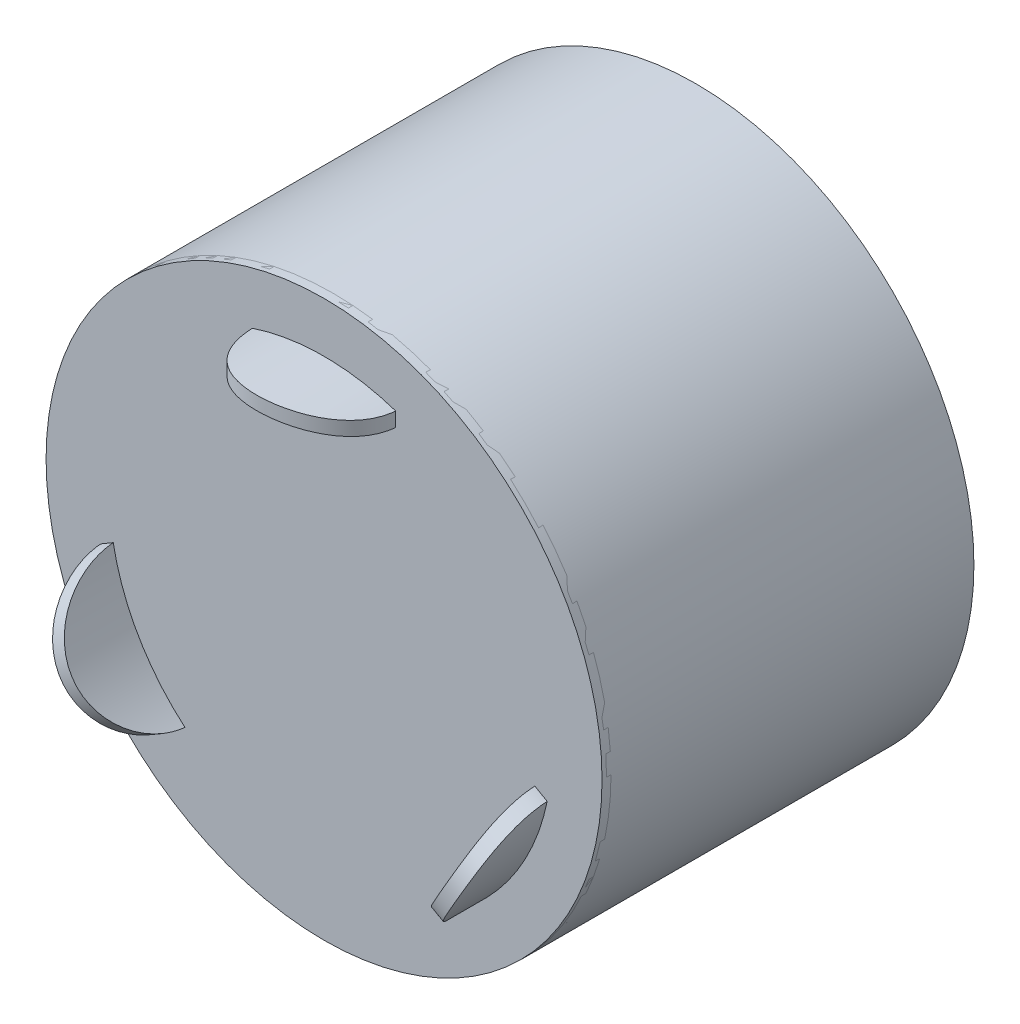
ISO-10303-21;
HEADER;
FILE_DESCRIPTION(('STEP AP214'),'2;1');
FILE_NAME('part.step','',(''),(''),'','','');
FILE_SCHEMA(('AUTOMOTIVE_DESIGN { 1 0 10303 214 1 1 1 1 }'));
ENDSEC;
DATA;
#1=APPLICATION_CONTEXT('core data for automotive mechanical design processes');
#2=APPLICATION_PROTOCOL_DEFINITION('international standard','automotive_design',2000,#1);
#3=PRODUCT_CONTEXT('',#1,'mechanical');
#4=PRODUCT('Part','Part','',(#3));
#5=PRODUCT_RELATED_PRODUCT_CATEGORY('part','',(#4));
#6=PRODUCT_DEFINITION_FORMATION('','',#4);
#7=PRODUCT_DEFINITION_CONTEXT('part definition',#1,'design');
#8=PRODUCT_DEFINITION('design','',#6,#7);
#9=PRODUCT_DEFINITION_SHAPE('','',#8);
#10=(LENGTH_UNIT() NAMED_UNIT(*) SI_UNIT(.MILLI.,.METRE.));
#11=(NAMED_UNIT(*) PLANE_ANGLE_UNIT() SI_UNIT($,.RADIAN.));
#12=(NAMED_UNIT(*) SI_UNIT($,.STERADIAN.) SOLID_ANGLE_UNIT());
#13=UNCERTAINTY_MEASURE_WITH_UNIT(LENGTH_MEASURE(1.E-05),#10,'distance_accuracy_value','');
#14=(GEOMETRIC_REPRESENTATION_CONTEXT(3) GLOBAL_UNCERTAINTY_ASSIGNED_CONTEXT((#13)) GLOBAL_UNIT_ASSIGNED_CONTEXT((#10,
#11,#12)) REPRESENTATION_CONTEXT('',''));
#15=CARTESIAN_POINT('',(0.,0.,0.));
#16=DIRECTION('',(0.,0.,1.));
#17=DIRECTION('',(1.,0.,0.));
#18=AXIS2_PLACEMENT_3D('',#15,#16,#17);
#19=CARTESIAN_POINT('',(0.,-38.9496964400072,-38.69132863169));
#20=DIRECTION('',(0.,0.,1.));
#21=DIRECTION('',(0.,-1.,0.));
#22=AXIS2_PLACEMENT_3D('',#19,#20,#21);
#23=CYLINDRICAL_SURFACE('',#22,58.5);
#24=CARTESIAN_POINT('',(0.,-38.9496964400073,-58.44132863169));
#25=DIRECTION('',(0.,0.,1.));
#26=DIRECTION('',(0.,-1.,0.));
#27=AXIS2_PLACEMENT_3D('',#24,#25,#26);
#28=CIRCLE('',#27,58.5);
#29=CARTESIAN_POINT('',(0.,-97.4496964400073,-58.4413286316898));
#30=VERTEX_POINT('',#29);
#31=EDGE_CURVE('E15',#30,#30,#28,.T.);
#32=ORIENTED_EDGE('',*,*,#31,.F.);
#33=EDGE_LOOP('',(#32));
#34=FACE_BOUND('',#33,.T.);
#35=CARTESIAN_POINT('',(0.,-38.9496964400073,-46.19132863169));
#36=DIRECTION('',(0.,0.,1.));
#37=DIRECTION('',(0.,-1.,0.));
#38=AXIS2_PLACEMENT_3D('',#35,#36,#37);
#39=CIRCLE('',#38,58.5);
#40=CARTESIAN_POINT('',(58.4930765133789,-38.0496964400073,-46.19132863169));
#41=VERTEX_POINT('',#40);
#42=CARTESIAN_POINT('',(58.4930765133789,-39.8496964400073,-46.19132863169));
#43=VERTEX_POINT('',#42);
#44=EDGE_CURVE('E113',#41,#43,#39,.T.);
#45=ORIENTED_EDGE('',*,*,#44,.T.);
#46=DIRECTION('',(0.,0.,1.));
#47=VECTOR('',#46,1.);
#48=CARTESIAN_POINT('',(58.4930765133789,-39.8496964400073,-61.4916696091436));
#49=LINE('',#48,#47);
#50=CARTESIAN_POINT('',(58.4930765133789,-39.8496964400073,-58.14132863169));
#51=VERTEX_POINT('',#50);
#52=EDGE_CURVE('E148',#51,#43,#49,.T.);
#53=ORIENTED_EDGE('',*,*,#52,.F.);
#54=CARTESIAN_POINT('',(0.,-38.9496964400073,-58.1413286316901));
#55=DIRECTION('',(0.,0.,1.));
#56=DIRECTION('',(0.,-1.,0.));
#57=AXIS2_PLACEMENT_3D('',#54,#55,#56);
#58=CIRCLE('',#57,58.5);
#59=CARTESIAN_POINT('',(58.4930765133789,-38.0496964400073,-58.1413286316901));
#60=VERTEX_POINT('',#59);
#61=EDGE_CURVE('E186',#51,#60,#58,.T.);
#62=ORIENTED_EDGE('',*,*,#61,.T.);
#63=DIRECTION('',(0.,0.,1.));
#64=VECTOR('',#63,1.);
#65=CARTESIAN_POINT('',(58.4930765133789,-38.0496964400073,-61.4916696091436));
#66=LINE('',#65,#64);
#67=EDGE_CURVE('E180',#60,#41,#66,.T.);
#68=ORIENTED_EDGE('',*,*,#67,.T.);
#69=EDGE_LOOP('',(#45,#53,#62,#68));
#70=FACE_BOUND('',#69,.T.);
#71=ADVANCED_FACE('F105',(#34,#70),#23,.F.);
#72=CARTESIAN_POINT('',(0.,-38.9496964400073,-46.19132863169));
#73=DIRECTION('',(0.,0.,1.));
#74=DIRECTION('',(0.,-1.,0.));
#75=AXIS2_PLACEMENT_3D('',#72,#73,#74);
#76=PLANE('',#75);
#77=CARTESIAN_POINT('',(0.,-38.9496964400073,-46.19132863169));
#78=DIRECTION('',(0.,0.,1.));
#79=DIRECTION('',(0.,-1.,0.));
#80=AXIS2_PLACEMENT_3D('',#77,#78,#79);
#81=CIRCLE('',#80,60.9);
#82=CARTESIAN_POINT('',(60.8927924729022,-38.0127733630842,-46.19132863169));
#83=VERTEX_POINT('',#82);
#84=CARTESIAN_POINT('',(60.8927924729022,-39.8866195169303,-46.19132863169));
#85=VERTEX_POINT('',#84);
#86=EDGE_CURVE('E160',#83,#85,#81,.T.);
#87=ORIENTED_EDGE('',*,*,#86,.T.);
#88=DIRECTION('',(-0.999881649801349,0.0153846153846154,0.));
#89=VECTOR('',#88,1.);
#90=CARTESIAN_POINT('',(0.,-38.9496964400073,-46.19132863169));
#91=LINE('',#90,#89);
#92=EDGE_CURVE('E145',#85,#43,#91,.T.);
#93=ORIENTED_EDGE('',*,*,#92,.T.);
#94=ORIENTED_EDGE('',*,*,#44,.F.);
#95=DIRECTION('',(-0.999881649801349,-0.0153846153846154,0.));
#96=VECTOR('',#95,1.);
#97=CARTESIAN_POINT('',(0.,-38.9496964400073,-46.19132863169));
#98=LINE('',#97,#96);
#99=EDGE_CURVE('E153',#83,#41,#98,.T.);
#100=ORIENTED_EDGE('',*,*,#99,.F.);
#101=EDGE_LOOP('',(#87,#93,#94,#100));
#102=FACE_BOUND('',#101,.T.);
#103=ADVANCED_FACE('F165',(#102),#76,.T.);
#104=CARTESIAN_POINT('',(0.,-38.9496964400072,-38.69132863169));
#105=DIRECTION('',(0.,0.,1.));
#106=DIRECTION('',(0.,-1.,0.));
#107=AXIS2_PLACEMENT_3D('',#104,#105,#106);
#108=CYLINDRICAL_SURFACE('',#107,60.9);
#109=CARTESIAN_POINT('',(0.,-38.9496964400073,-58.44132863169));
#110=DIRECTION('',(0.,0.,1.));
#111=DIRECTION('',(0.,-1.,0.));
#112=AXIS2_PLACEMENT_3D('',#109,#110,#111);
#113=CIRCLE('',#112,60.9);
#114=CARTESIAN_POINT('',(0.,-99.8496964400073,-58.4413286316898));
#115=VERTEX_POINT('',#114);
#116=EDGE_CURVE('E166',#115,#115,#113,.T.);
#117=ORIENTED_EDGE('',*,*,#116,.T.);
#118=EDGE_LOOP('',(#117));
#119=FACE_BOUND('',#118,.T.);
#120=CARTESIAN_POINT('',(0.,-38.9496964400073,-58.1413286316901));
#121=DIRECTION('',(0.,0.,1.));
#122=DIRECTION('',(0.,-1.,0.));
#123=AXIS2_PLACEMENT_3D('',#120,#121,#122);
#124=CIRCLE('',#123,60.9);
#125=CARTESIAN_POINT('',(60.8927924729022,-38.0127733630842,-58.1413286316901));
#126=VERTEX_POINT('',#125);
#127=CARTESIAN_POINT('',(60.8927924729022,-39.8866195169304,-58.14132863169));
#128=VERTEX_POINT('',#127);
#129=EDGE_CURVE('E161',#126,#128,#124,.F.);
#130=ORIENTED_EDGE('',*,*,#129,.T.);
#131=DIRECTION('',(0.,0.,1.));
#132=VECTOR('',#131,1.);
#133=CARTESIAN_POINT('',(60.8927924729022,-39.8866195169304,-61.4916696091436));
#134=LINE('',#133,#132);
#135=EDGE_CURVE('E120',#128,#85,#134,.T.);
#136=ORIENTED_EDGE('',*,*,#135,.T.);
#137=ORIENTED_EDGE('',*,*,#86,.F.);
#138=DIRECTION('',(0.,0.,1.));
#139=VECTOR('',#138,1.);
#140=CARTESIAN_POINT('',(60.8927924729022,-38.0127733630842,-61.4916696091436));
#141=LINE('',#140,#139);
#142=EDGE_CURVE('E162',#126,#83,#141,.T.);
#143=ORIENTED_EDGE('',*,*,#142,.F.);
#144=EDGE_LOOP('',(#130,#136,#137,#143));
#145=FACE_BOUND('',#144,.T.);
#146=ADVANCED_FACE('F158',(#119,#145),#108,.T.);
#147=CARTESIAN_POINT('',(0.,-38.9496964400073,-58.44132863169));
#148=DIRECTION('',(0.,0.,1.));
#149=DIRECTION('',(0.,-1.,0.));
#150=AXIS2_PLACEMENT_3D('',#147,#148,#149);
#151=PLANE('',#150);
#152=ORIENTED_EDGE('',*,*,#31,.T.);
#153=EDGE_LOOP('',(#152));
#154=FACE_BOUND('',#153,.T.);
#155=ADVANCED_FACE('F107',(#154),#151,.T.);
#156=CARTESIAN_POINT('',(0.,-38.9496964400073,-58.44132863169));
#157=DIRECTION('',(0.,0.,1.));
#158=DIRECTION('',(0.,-1.,0.));
#159=AXIS2_PLACEMENT_3D('',#156,#157,#158);
#160=PLANE('',#159);
#161=CARTESIAN_POINT('',(0.,-38.9496964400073,-58.44132863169));
#162=DIRECTION('',(0.,0.,1.));
#163=DIRECTION('',(0.,-1.,0.));
#164=AXIS2_PLACEMENT_3D('',#161,#162,#163);
#165=CIRCLE('',#164,63.9);
#166=CARTESIAN_POINT('',(0.,-102.849696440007,-58.4413286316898));
#167=VERTEX_POINT('',#166);
#168=EDGE_CURVE('E169',#167,#167,#165,.T.);
#169=ORIENTED_EDGE('',*,*,#168,.T.);
#170=EDGE_LOOP('',(#169));
#171=FACE_BOUND('',#170,.T.);
#172=ORIENTED_EDGE('',*,*,#116,.F.);
#173=EDGE_LOOP('',(#172));
#174=FACE_BOUND('',#173,.T.);
#175=ADVANCED_FACE('F204',(#171,#174),#160,.T.);
#176=CARTESIAN_POINT('',(0.,-38.9496964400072,-38.69132863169));
#177=DIRECTION('',(0.,0.,1.));
#178=DIRECTION('',(0.,-1.,0.));
#179=AXIS2_PLACEMENT_3D('',#176,#177,#178);
#180=CYLINDRICAL_SURFACE('',#179,63.9);
#181=CARTESIAN_POINT('',(0.,-38.9496964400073,-60.84132863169));
#182=DIRECTION('',(0.,0.,1.));
#183=DIRECTION('',(0.,-1.,0.));
#184=AXIS2_PLACEMENT_3D('',#181,#182,#183);
#185=CIRCLE('',#184,63.9);
#186=CARTESIAN_POINT('',(0.,-102.849696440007,-60.8413286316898));
#187=VERTEX_POINT('',#186);
#188=EDGE_CURVE('E174',#187,#187,#185,.T.);
#189=ORIENTED_EDGE('',*,*,#188,.T.);
#190=EDGE_LOOP('',(#189));
#191=FACE_BOUND('',#190,.T.);
#192=ORIENTED_EDGE('',*,*,#168,.F.);
#193=EDGE_LOOP('',(#192));
#194=FACE_BOUND('',#193,.T.);
#195=ADVANCED_FACE('F207',(#191,#194),#180,.T.);
#196=CARTESIAN_POINT('',(0.,-38.9496964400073,-60.84132863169));
#197=DIRECTION('',(0.,0.,-1.));
#198=DIRECTION('',(0.,1.,0.));
#199=AXIS2_PLACEMENT_3D('',#196,#197,#198);
#200=PLANE('',#199);
#201=ORIENTED_EDGE('',*,*,#188,.F.);
#202=EDGE_LOOP('',(#201));
#203=FACE_BOUND('',#202,.T.);
#204=ADVANCED_FACE('F211',(#203),#200,.T.);
#205=CARTESIAN_POINT('',(0.,-38.9496964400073,-61.4916696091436));
#206=DIRECTION('',(0.0153846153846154,0.999881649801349,0.));
#207=DIRECTION('',(0.999881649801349,-0.0153846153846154,0.));
#208=AXIS2_PLACEMENT_3D('',#205,#206,#207);
#209=PLANE('',#208);
#210=ORIENTED_EDGE('',*,*,#52,.T.);
#211=ORIENTED_EDGE('',*,*,#92,.F.);
#212=ORIENTED_EDGE('',*,*,#135,.F.);
#213=DIRECTION('',(0.999881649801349,-0.0153846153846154,0.));
#214=VECTOR('',#213,1.);
#215=CARTESIAN_POINT('',(0.,-38.9496964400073,-58.1413286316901));
#216=LINE('',#215,#214);
#217=EDGE_CURVE('E177',#51,#128,#216,.T.);
#218=ORIENTED_EDGE('',*,*,#217,.F.);
#219=EDGE_LOOP('',(#210,#211,#212,#218));
#220=FACE_BOUND('',#219,.T.);
#221=ADVANCED_FACE('F146',(#220),#209,.T.);
#222=CARTESIAN_POINT('',(0.,-38.9496964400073,-61.4916696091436));
#223=DIRECTION('',(-0.0153846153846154,0.999881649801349,0.));
#224=DIRECTION('',(0.999881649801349,0.0153846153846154,0.));
#225=AXIS2_PLACEMENT_3D('',#222,#223,#224);
#226=PLANE('',#225);
#227=DIRECTION('',(0.999881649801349,0.0153846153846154,0.));
#228=VECTOR('',#227,1.);
#229=CARTESIAN_POINT('',(0.,-38.9496964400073,-58.1413286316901));
#230=LINE('',#229,#228);
#231=EDGE_CURVE('E128',#60,#126,#230,.T.);
#232=ORIENTED_EDGE('',*,*,#231,.T.);
#233=ORIENTED_EDGE('',*,*,#142,.T.);
#234=ORIENTED_EDGE('',*,*,#99,.T.);
#235=ORIENTED_EDGE('',*,*,#67,.F.);
#236=EDGE_LOOP('',(#232,#233,#234,#235));
#237=FACE_BOUND('',#236,.T.);
#238=ADVANCED_FACE('F190',(#237),#226,.F.);
#239=CARTESIAN_POINT('',(0.,-38.9496964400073,-58.1413286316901));
#240=DIRECTION('',(0.,0.,1.));
#241=DIRECTION('',(0.,-1.,0.));
#242=AXIS2_PLACEMENT_3D('',#239,#240,#241);
#243=PLANE('',#242);
#244=ORIENTED_EDGE('',*,*,#61,.F.);
#245=ORIENTED_EDGE('',*,*,#217,.T.);
#246=ORIENTED_EDGE('',*,*,#129,.F.);
#247=ORIENTED_EDGE('',*,*,#231,.F.);
#248=EDGE_LOOP('',(#244,#245,#246,#247));
#249=FACE_BOUND('',#248,.T.);
#250=ADVANCED_FACE('F191',(#249),#243,.T.);
#251=CLOSED_SHELL('',(#71,#103,#146,#155,#175,#195,#204,#221,#238,#250));
#252=MANIFOLD_SOLID_BREP('B2',#251);
#253=CARTESIAN_POINT('',(0.,-38.9496964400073,-59.6413286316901));
#254=DIRECTION('',(0.,0.,1.));
#255=DIRECTION('',(0.,-1.,0.));
#256=AXIS2_PLACEMENT_3D('',#253,#254,#255);
#257=PLANE('',#256);
#258=CARTESIAN_POINT('',(0.,-38.9496964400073,-59.6413286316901));
#259=DIRECTION('',(0.,0.,1.));
#260=DIRECTION('',(0.,-1.,0.));
#261=AXIS2_PLACEMENT_3D('',#258,#259,#260);
#262=CIRCLE('',#261,20.75);
#263=CARTESIAN_POINT('',(0.,-59.6996964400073,-59.64132863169));
#264=VERTEX_POINT('',#263);
#265=EDGE_CURVE('E312',#264,#264,#262,.T.);
#266=ORIENTED_EDGE('',*,*,#265,.F.);
#267=EDGE_LOOP('',(#266));
#268=FACE_BOUND('',#267,.T.);
#269=ADVANCED_FACE('F306',(#268),#257,.F.);
#270=CARTESIAN_POINT('',(0.,-38.9496964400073,-58.44132863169));
#271=DIRECTION('',(0.,0.,1.));
#272=DIRECTION('',(0.,-1.,0.));
#273=AXIS2_PLACEMENT_3D('',#270,#271,#272);
#274=PLANE('',#273);
#275=CARTESIAN_POINT('',(0.,-38.9496964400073,-58.44132863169));
#276=DIRECTION('',(0.,0.,1.));
#277=DIRECTION('',(0.,-1.,0.));
#278=AXIS2_PLACEMENT_3D('',#275,#276,#277);
#279=CIRCLE('',#278,20.75);
#280=CARTESIAN_POINT('',(0.,-59.6996964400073,-58.44132863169));
#281=VERTEX_POINT('',#280);
#282=EDGE_CURVE('E104',#281,#281,#279,.T.);
#283=ORIENTED_EDGE('',*,*,#282,.T.);
#284=EDGE_LOOP('',(#283));
#285=FACE_BOUND('',#284,.T.);
#286=ADVANCED_FACE('F322',(#285),#274,.T.);
#287=CARTESIAN_POINT('',(0.,-38.9496964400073,-53.69132863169));
#288=DIRECTION('',(0.,0.,1.));
#289=DIRECTION('',(0.,-1.,0.));
#290=AXIS2_PLACEMENT_3D('',#287,#288,#289);
#291=CYLINDRICAL_SURFACE('',#290,20.75);
#292=ORIENTED_EDGE('',*,*,#265,.T.);
#293=EDGE_LOOP('',(#292));
#294=FACE_BOUND('',#293,.T.);
#295=ORIENTED_EDGE('',*,*,#282,.F.);
#296=EDGE_LOOP('',(#295));
#297=FACE_BOUND('',#296,.T.);
#298=ADVANCED_FACE('F318',(#294,#297),#291,.T.);
#299=CLOSED_SHELL('',(#269,#286,#298));
#300=MANIFOLD_SOLID_BREP('B9_NOT_SHOWN',#299);
#301=CARTESIAN_POINT('',(0.,-38.9496964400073,-46.19132863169));
#302=DIRECTION('',(0.,0.,1.));
#303=DIRECTION('',(0.,-1.,0.));
#304=AXIS2_PLACEMENT_3D('',#301,#302,#303);
#305=PLANE('',#304);
#306=CARTESIAN_POINT('',(0.,-38.9496964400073,-46.19132863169));
#307=DIRECTION('',(0.,0.,1.));
#308=DIRECTION('',(0.,-1.,0.));
#309=AXIS2_PLACEMENT_3D('',#306,#307,#308);
#310=CIRCLE('',#309,60.9);
#311=CARTESIAN_POINT('',(0.,-99.8496964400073,-46.1913286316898));
#312=VERTEX_POINT('',#311);
#313=EDGE_CURVE('E305',#312,#312,#310,.T.);
#314=ORIENTED_EDGE('',*,*,#313,.T.);
#315=EDGE_LOOP('',(#314));
#316=FACE_BOUND('',#315,.T.);
#317=CARTESIAN_POINT('',(0.,-38.9496964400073,-46.19132863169));
#318=DIRECTION('',(0.,0.,1.));
#319=DIRECTION('',(0.,-1.,0.));
#320=AXIS2_PLACEMENT_3D('',#317,#318,#319);
#321=CIRCLE('',#320,58.5);
#322=CARTESIAN_POINT('',(0.,-97.4496964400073,-46.1913286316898));
#323=VERTEX_POINT('',#322);
#324=EDGE_CURVE('E377',#323,#323,#321,.T.);
#325=ORIENTED_EDGE('',*,*,#324,.F.);
#326=EDGE_LOOP('',(#325));
#327=FACE_BOUND('',#326,.T.);
#328=ADVANCED_FACE('F363',(#316,#327),#305,.T.);
#329=CARTESIAN_POINT('',(0.,-38.9496964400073,-53.69132863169));
#330=DIRECTION('',(0.,0.,1.));
#331=DIRECTION('',(0.,-1.,0.));
#332=AXIS2_PLACEMENT_3D('',#329,#330,#331);
#333=CYLINDRICAL_SURFACE('',#332,60.9);
#334=CARTESIAN_POINT('',(0.,-38.9496964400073,-58.44132863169));
#335=DIRECTION('',(0.,0.,1.));
#336=DIRECTION('',(0.,-1.,0.));
#337=AXIS2_PLACEMENT_3D('',#334,#335,#336);
#338=CIRCLE('',#337,60.9);
#339=CARTESIAN_POINT('',(0.,-99.8496964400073,-58.4413286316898));
#340=VERTEX_POINT('',#339);
#341=EDGE_CURVE('E369',#340,#340,#338,.T.);
#342=ORIENTED_EDGE('',*,*,#341,.T.);
#343=EDGE_LOOP('',(#342));
#344=FACE_BOUND('',#343,.T.);
#345=ORIENTED_EDGE('',*,*,#313,.F.);
#346=EDGE_LOOP('',(#345));
#347=FACE_BOUND('',#346,.T.);
#348=ADVANCED_FACE('F387',(#344,#347),#333,.T.);
#349=CARTESIAN_POINT('',(0.,-38.9496964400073,-58.44132863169));
#350=DIRECTION('',(0.,0.,1.));
#351=DIRECTION('',(0.,-1.,0.));
#352=AXIS2_PLACEMENT_3D('',#349,#350,#351);
#353=PLANE('',#352);
#354=ORIENTED_EDGE('',*,*,#341,.F.);
#355=EDGE_LOOP('',(#354));
#356=FACE_BOUND('',#355,.T.);
#357=CARTESIAN_POINT('',(0.,-38.9496964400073,-58.44132863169));
#358=DIRECTION('',(0.,0.,1.));
#359=DIRECTION('',(0.,-1.,0.));
#360=AXIS2_PLACEMENT_3D('',#357,#358,#359);
#361=CIRCLE('',#360,58.5);
#362=CARTESIAN_POINT('',(0.,-97.4496964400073,-58.4413286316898));
#363=VERTEX_POINT('',#362);
#364=EDGE_CURVE('E373',#363,#363,#361,.T.);
#365=ORIENTED_EDGE('',*,*,#364,.T.);
#366=EDGE_LOOP('',(#365));
#367=FACE_BOUND('',#366,.T.);
#368=ADVANCED_FACE('F391',(#356,#367),#353,.F.);
#369=CARTESIAN_POINT('',(0.,-38.9496964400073,-53.69132863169));
#370=DIRECTION('',(0.,0.,1.));
#371=DIRECTION('',(0.,-1.,0.));
#372=AXIS2_PLACEMENT_3D('',#369,#370,#371);
#373=CYLINDRICAL_SURFACE('',#372,58.5);
#374=ORIENTED_EDGE('',*,*,#324,.T.);
#375=EDGE_LOOP('',(#374));
#376=FACE_BOUND('',#375,.T.);
#377=ORIENTED_EDGE('',*,*,#364,.F.);
#378=EDGE_LOOP('',(#377));
#379=FACE_BOUND('',#378,.T.);
#380=ADVANCED_FACE('F383',(#376,#379),#373,.F.);
#381=CLOSED_SHELL('',(#328,#348,#368,#380));
#382=MANIFOLD_SOLID_BREP('B99_NOT_SHOWN',#381);
#383=CARTESIAN_POINT('',(-64.3456875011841,-1.79969644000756,37.3586713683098));
#384=DIRECTION('',(0.866025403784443,-0.499999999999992,0.));
#385=DIRECTION('',(-0.499999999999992,-0.866025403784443,0.));
#386=AXIS2_PLACEMENT_3D('',#383,#384,#385);
#387=CYLINDRICAL_SURFACE('',#386,19.2);
#388=CARTESIAN_POINT('',(56.3545452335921,-49.3157579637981,37.35867136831));
#389=CARTESIAN_POINT('',(56.354542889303,-49.315755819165,37.620513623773));
#390=CARTESIAN_POINT('',(56.353516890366,-49.3213503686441,37.8823220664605));
#391=CARTESIAN_POINT('',(56.3494005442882,-49.3436968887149,38.405436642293));
#392=CARTESIAN_POINT('',(56.3463102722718,-49.360448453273,38.6667427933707));
#393=CARTESIAN_POINT('',(56.3339214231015,-49.4273634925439,39.4490290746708));
#394=CARTESIAN_POINT('',(56.3215048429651,-49.494187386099,39.9686341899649));
#395=CARTESIAN_POINT('',(56.2880949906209,-49.6710942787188,40.9984651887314));
#396=CARTESIAN_POINT('',(56.2671273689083,-49.7810478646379,41.5087143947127));
#397=CARTESIAN_POINT('',(56.2161094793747,-50.0427932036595,42.5179261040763));
#398=CARTESIAN_POINT('',(56.1860588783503,-50.1945864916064,43.0168881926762));
#399=CARTESIAN_POINT('',(56.1162297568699,-50.5380270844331,43.9998132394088));
#400=CARTESIAN_POINT('',(56.0764575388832,-50.7296485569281,44.4837856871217));
#401=CARTESIAN_POINT('',(55.9863723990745,-51.1506147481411,45.4340372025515));
#402=CARTESIAN_POINT('',(55.9360588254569,-51.379961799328,45.9003151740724));
#403=CARTESIAN_POINT('',(55.8239660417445,-51.8740527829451,46.8125790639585));
#404=CARTESIAN_POINT('',(55.7621809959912,-52.1388147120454,47.258554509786));
#405=CARTESIAN_POINT('',(55.6262018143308,-52.701034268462,48.1274013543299));
#406=CARTESIAN_POINT('',(55.5520073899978,-52.9984926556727,48.5502722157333));
#407=CARTESIAN_POINT('',(55.3873412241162,-53.6345226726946,49.3851612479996));
#408=CARTESIAN_POINT('',(55.2963836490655,-53.9741816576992,49.7962556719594));
#409=CARTESIAN_POINT('',(55.0990330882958,-54.6825187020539,50.5886471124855));
#410=CARTESIAN_POINT('',(54.9926401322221,-55.0511967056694,50.9699441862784));
#411=CARTESIAN_POINT('',(54.7633718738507,-55.8145097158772,51.7005461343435));
#412=CARTESIAN_POINT('',(54.6404905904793,-56.2091541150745,52.0498393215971));
#413=CARTESIAN_POINT('',(54.3773953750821,-57.020969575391,52.7140311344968));
#414=CARTESIAN_POINT('',(54.2371814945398,-57.4381405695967,53.0289298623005));
#415=CARTESIAN_POINT('',(53.9347079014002,-58.3030610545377,53.6301502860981));
#416=CARTESIAN_POINT('',(53.7719574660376,-58.7513307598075,53.9154780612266));
#417=CARTESIAN_POINT('',(53.4269306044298,-59.6642119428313,54.4453929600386));
#418=CARTESIAN_POINT('',(53.2446527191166,-60.1288246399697,54.6899770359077));
#419=CARTESIAN_POINT('',(52.860645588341,-61.0698254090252,55.1360665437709));
#420=CARTESIAN_POINT('',(52.6589378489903,-61.546200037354,55.3376188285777));
#421=CARTESIAN_POINT('',(52.2361796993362,-62.5070043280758,55.6961092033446));
#422=CARTESIAN_POINT('',(52.0151341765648,-62.991431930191,55.8530585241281));
#423=CARTESIAN_POINT('',(51.6220330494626,-63.8213773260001,56.0815695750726));
#424=CARTESIAN_POINT('',(51.4546226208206,-64.1659672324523,56.1646740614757));
#425=CARTESIAN_POINT('',(51.1108657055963,-64.8556380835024,56.3074746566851));
#426=CARTESIAN_POINT('',(50.9345178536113,-65.200719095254,56.3671671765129));
#427=CARTESIAN_POINT('',(50.5734468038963,-65.8897737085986,56.4627978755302));
#428=CARTESIAN_POINT('',(50.3887239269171,-66.2337473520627,56.4987369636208));
#429=CARTESIAN_POINT('',(50.0115873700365,-66.9190390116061,56.5466728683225));
#430=CARTESIAN_POINT('',(49.8191750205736,-67.2603574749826,56.5586738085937));
#431=CARTESIAN_POINT('',(49.3615728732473,-68.0529397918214,56.5586681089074));
#432=CARTESIAN_POINT('',(49.0936335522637,-68.5026517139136,56.5372507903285));
#433=CARTESIAN_POINT('',(48.5473872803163,-69.3916663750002,56.4517736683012));
#434=CARTESIAN_POINT('',(48.2690784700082,-69.8309672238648,56.3877061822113));
#435=CARTESIAN_POINT('',(47.7043090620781,-70.6964456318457,56.2174705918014));
#436=CARTESIAN_POINT('',(47.417842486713,-71.1226130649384,56.111270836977));
#437=CARTESIAN_POINT('',(46.8396129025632,-71.9587719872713,55.8577518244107));
#438=CARTESIAN_POINT('',(46.5478501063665,-72.3687641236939,55.7104342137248));
#439=CARTESIAN_POINT('',(45.9624111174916,-73.1694605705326,55.3763029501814));
#440=CARTESIAN_POINT('',(45.6687399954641,-73.5602022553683,55.1895698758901));
#441=CARTESIAN_POINT('',(45.0817907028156,-74.3213396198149,54.7779503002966));
#442=CARTESIAN_POINT('',(44.7885125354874,-74.6917351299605,54.5530634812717));
#443=CARTESIAN_POINT('',(44.2053023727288,-75.4105725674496,54.0668381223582));
#444=CARTESIAN_POINT('',(43.9153704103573,-75.7590142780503,53.8054992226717));
#445=CARTESIAN_POINT('',(43.3418269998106,-76.4326493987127,53.2481935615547));
#446=CARTESIAN_POINT('',(43.0582158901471,-76.7578415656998,52.9522249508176));
#447=CARTESIAN_POINT('',(42.4915191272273,-77.3937841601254,52.3177401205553));
#448=CARTESIAN_POINT('',(42.2087319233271,-77.7037560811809,51.9781766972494));
#449=CARTESIAN_POINT('',(41.6563598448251,-78.296894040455,51.266459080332));
#450=CARTESIAN_POINT('',(41.3867752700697,-78.5800594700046,50.8943041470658));
#451=CARTESIAN_POINT('',(40.8640624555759,-79.1188302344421,50.1196780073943));
#452=CARTESIAN_POINT('',(40.6109350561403,-79.3744341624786,49.7172052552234));
#453=CARTESIAN_POINT('',(40.1242773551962,-79.8575197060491,48.8841875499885));
#454=CARTESIAN_POINT('',(39.8907558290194,-80.0849887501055,48.4536301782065));
#455=CARTESIAN_POINT('',(39.4400398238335,-80.5173964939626,47.5540575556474));
#456=CARTESIAN_POINT('',(39.2235318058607,-80.7214706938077,47.0842818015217));
#457=CARTESIAN_POINT('',(38.8182285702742,-81.0983823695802,46.121131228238));
#458=CARTESIAN_POINT('',(38.6294201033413,-81.2712347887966,45.6277678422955));
#459=CARTESIAN_POINT('',(38.2826281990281,-81.5851873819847,44.620877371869));
#460=CARTESIAN_POINT('',(38.1246265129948,-81.7263063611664,44.107362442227));
#461=CARTESIAN_POINT('',(37.8421494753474,-81.9764019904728,43.0636300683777));
#462=CARTESIAN_POINT('',(37.7176654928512,-82.0853869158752,42.5334169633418));
#463=CARTESIAN_POINT('',(37.5360333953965,-82.2434142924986,41.6189109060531));
#464=CARTESIAN_POINT('',(37.4698569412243,-82.3006535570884,41.2377817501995));
#465=CARTESIAN_POINT('',(37.3559300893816,-82.3988637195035,40.4707610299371));
#466=CARTESIAN_POINT('',(37.3081756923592,-82.4398381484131,40.0848705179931));
#467=CARTESIAN_POINT('',(37.2315723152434,-82.5054389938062,39.3098042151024));
#468=CARTESIAN_POINT('',(37.2027250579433,-82.5300639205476,38.9206281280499));
#469=CARTESIAN_POINT('',(37.1641914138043,-82.5629166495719,38.1405290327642));
#470=CARTESIAN_POINT('',(37.154510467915,-82.5711397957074,37.7496055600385));
#471=CARTESIAN_POINT('',(37.1545452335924,-82.5711334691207,37.3586713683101));
#472=B_SPLINE_CURVE_WITH_KNOTS('',3,(#388,#389,#390,#391,#392,#393,#394,#395,#396,#397,#398,
#399,#400,#401,#402,#403,#404,#405,#406,#407,#408,#409,#410,#411,#412,#413,#414,#415,#416,#417,
#418,#419,#420,#421,#422,#423,#424,#425,#426,#427,#428,#429,#430,#431,#432,#433,#434,#435,#436,
#437,#438,#439,#440,#441,#442,#443,#444,#445,#446,#447,#448,#449,#450,#451,#452,#453,#454,#455,
#456,#457,#458,#459,#460,#461,#462,#463,#464,#465,#466,#467,#468,#469,#470,#471),.UNSPECIFIED.,
.F.,.F.,(4,2,2,2,2,2,2,2,2,2,2,2,2,2,2,2,2,2,2,2,2,2,2,2,2,2,2,2,2,2,2,2,2,2,2,2,2,2,2,2,2,4),
(0.,0.785397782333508,1.57076698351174,3.14073653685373,4.70603090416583,6.27138270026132,
7.83572236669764,9.40015878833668,10.965393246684,12.530664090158,14.1517144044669,
15.7727616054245,17.3943984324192,19.0160304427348,20.6811893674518,22.346472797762,
24.0099337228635,25.6729754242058,26.8482778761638,28.0237604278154,29.1991979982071,
30.3744330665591,31.9441540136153,33.5141577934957,35.0853432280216,36.6564657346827,
38.2244069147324,39.7923611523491,41.3603308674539,42.9283843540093,44.5458728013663,
46.1633979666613,47.7810056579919,49.3993335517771,51.0654876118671,52.7308420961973,
54.3952070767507,56.0591430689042,57.2315364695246,58.4036752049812,59.575920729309,
60.7484989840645),.UNSPECIFIED.);
#473=CARTESIAN_POINT('',(56.354545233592,-49.3157579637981,37.35867136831));
#474=VERTEX_POINT('',#473);
#475=CARTESIAN_POINT('',(37.1545452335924,-82.5711334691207,37.3586713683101));
#476=VERTEX_POINT('',#475);
#477=EDGE_CURVE('E466',#474,#476,#472,.T.);
#478=ORIENTED_EDGE('',*,*,#477,.T.);
#479=DIRECTION('',(0.866025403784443,-0.499999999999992,0.));
#480=VECTOR('',#479,1.);
#481=CARTESIAN_POINT('',(-73.945687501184,-18.4273841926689,37.3586713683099));
#482=LINE('',#481,#480);
#483=CARTESIAN_POINT('',(40.4512487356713,-84.4744861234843,37.3586713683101));
#484=VERTEX_POINT('',#483);
#485=EDGE_CURVE('E361',#476,#484,#482,.T.);
#486=ORIENTED_EDGE('',*,*,#485,.T.);
#487=CARTESIAN_POINT('',(40.4512487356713,-84.4744861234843,37.3586713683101));
#488=CARTESIAN_POINT('',(40.451245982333,-84.474485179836,37.6214665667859));
#489=CARTESIAN_POINT('',(40.4554997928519,-84.4707092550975,37.8842280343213));
#490=CARTESIAN_POINT('',(40.4724834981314,-84.4556110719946,38.409250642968));
#491=CARTESIAN_POINT('',(40.4852130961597,-84.4442890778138,38.6715118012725));
#492=CARTESIAN_POINT('',(40.5360448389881,-84.3990229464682,39.4566819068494));
#493=CARTESIAN_POINT('',(40.5867900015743,-84.353778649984,39.9782204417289));
#494=CARTESIAN_POINT('',(40.7209253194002,-84.2335154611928,41.0120617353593));
#495=CARTESIAN_POINT('',(40.8042263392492,-84.158577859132,41.5243857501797));
#496=CARTESIAN_POINT('',(41.0020701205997,-83.9792207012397,42.5377427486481));
#497=CARTESIAN_POINT('',(41.1166138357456,-83.8748002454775,43.0387753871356));
#498=CARTESIAN_POINT('',(41.3750092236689,-83.6369362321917,44.0258557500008));
#499=CARTESIAN_POINT('',(41.5188461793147,-83.503507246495,44.5119108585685));
#500=CARTESIAN_POINT('',(41.8336900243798,-83.2080171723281,45.4662678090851));
#501=CARTESIAN_POINT('',(42.0046979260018,-83.0459550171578,45.9345689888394));
#502=CARTESIAN_POINT('',(42.279716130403,-82.7817822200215,46.6215211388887));
#503=CARTESIAN_POINT('',(42.3745132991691,-82.6901720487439,46.8480060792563));
#504=CARTESIAN_POINT('',(42.5699249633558,-82.5000130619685,47.2954081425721));
#505=CARTESIAN_POINT('',(42.6705379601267,-82.4014660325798,47.516326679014));
#506=CARTESIAN_POINT('',(42.980660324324,-82.0954633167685,48.1703702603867));
#507=CARTESIAN_POINT('',(43.1984636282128,-81.8776359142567,48.5948095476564));
#508=CARTESIAN_POINT('',(43.6604586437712,-81.4077495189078,49.4307796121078));
#509=CARTESIAN_POINT('',(43.9052648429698,-81.1548293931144,49.8414845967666));
#510=CARTESIAN_POINT('',(44.4122336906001,-80.6210169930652,50.6329420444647));
#511=CARTESIAN_POINT('',(44.674396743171,-80.3401240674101,51.0136938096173));
#512=CARTESIAN_POINT('',(45.2129745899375,-79.7511204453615,51.7429724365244));
#513=CARTESIAN_POINT('',(45.4893943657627,-79.4430002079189,52.0914879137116));
#514=CARTESIAN_POINT('',(46.0531771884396,-78.8006369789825,52.7538761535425));
#515=CARTESIAN_POINT('',(46.3405401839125,-78.4663941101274,53.0677490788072));
#516=CARTESIAN_POINT('',(46.9298274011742,-77.7648482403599,53.6656426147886));
#517=CARTESIAN_POINT('',(47.231935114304,-77.396952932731,53.9487884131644));
#518=CARTESIAN_POINT('',(47.8407889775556,-76.6366447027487,54.4743579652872));
#519=CARTESIAN_POINT('',(48.1475354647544,-76.2442299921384,54.7167787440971));
#520=CARTESIAN_POINT('',(48.7618728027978,-75.4373191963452,55.1586164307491));
#521=CARTESIAN_POINT('',(49.0694623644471,-75.0228477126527,55.3580800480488));
#522=CARTESIAN_POINT('',(49.6824322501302,-74.173833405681,55.712529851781));
#523=CARTESIAN_POINT('',(49.9878131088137,-73.7392956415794,55.8675271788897));
#524=CARTESIAN_POINT('',(50.5026643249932,-72.9854522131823,56.0921457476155));
#525=CARTESIAN_POINT('',(50.7135243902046,-72.6705172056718,56.1734386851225));
#526=CARTESIAN_POINT('',(51.1315553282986,-72.033214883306,56.3130889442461));
#527=CARTESIAN_POINT('',(51.3387265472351,-71.7108482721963,56.3714484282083));
#528=CARTESIAN_POINT('',(51.7484166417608,-71.0598087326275,56.4649449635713));
#529=CARTESIAN_POINT('',(51.9509350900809,-70.7311352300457,56.5000798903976));
#530=CARTESIAN_POINT('',(52.3503467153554,-70.0688348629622,56.5469424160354));
#531=CARTESIAN_POINT('',(52.547240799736,-69.735208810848,56.5586738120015));
#532=CARTESIAN_POINT('',(53.0035125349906,-68.944915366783,56.5586680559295));
#533=CARTESIAN_POINT('',(53.2602209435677,-68.4866684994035,56.5371057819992));
#534=CARTESIAN_POINT('',(53.7600912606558,-67.5667678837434,56.4510436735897));
#535=CARTESIAN_POINT('',(54.0032506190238,-67.1051135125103,56.3865357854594));
#536=CARTESIAN_POINT('',(54.4747621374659,-66.1816493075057,56.2151084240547));
#537=CARTESIAN_POINT('',(54.7031026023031,-65.7198396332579,56.1081559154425));
#538=CARTESIAN_POINT('',(55.1437063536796,-64.8000678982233,55.8528032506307));
#539=CARTESIAN_POINT('',(55.3559703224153,-64.3421056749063,55.704404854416));
#540=CARTESIAN_POINT('',(55.7633806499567,-63.4344346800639,55.3677416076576));
#541=CARTESIAN_POINT('',(55.9585581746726,-62.9847121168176,55.1795515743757));
#542=CARTESIAN_POINT('',(56.3319193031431,-62.0961248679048,54.7646493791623));
#543=CARTESIAN_POINT('',(56.5101027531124,-61.6572602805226,54.5379368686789));
#544=CARTESIAN_POINT('',(56.8494658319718,-60.7937679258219,54.0476933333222));
#545=CARTESIAN_POINT('',(57.0106455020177,-60.3691401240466,53.7841623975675));
#546=CARTESIAN_POINT('',(57.3162655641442,-59.5373641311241,53.2221224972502));
#547=CARTESIAN_POINT('',(57.4607053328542,-59.1302165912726,52.923612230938));
#548=CARTESIAN_POINT('',(57.7371781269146,-58.3253109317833,52.2846490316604));
#549=CARTESIAN_POINT('',(57.8687444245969,-57.9281445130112,51.9432482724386));
#550=CARTESIAN_POINT('',(58.1153770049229,-57.1589288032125,51.2277769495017));
#551=CARTESIAN_POINT('',(58.2304429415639,-56.7868800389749,50.8537057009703));
#552=CARTESIAN_POINT('',(58.4449492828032,-56.0709574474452,50.0750760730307));
#553=CARTESIAN_POINT('',(58.5443859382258,-55.7270903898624,49.6705104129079));
#554=CARTESIAN_POINT('',(58.6824485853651,-55.2349437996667,49.0428888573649));
#555=CARTESIAN_POINT('',(58.7266221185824,-55.0748319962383,48.8302115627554));
#556=CARTESIAN_POINT('',(58.8114134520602,-54.7627855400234,48.3981579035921));
#557=CARTESIAN_POINT('',(58.8520302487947,-54.6108531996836,48.1787796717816));
#558=CARTESIAN_POINT('',(58.9706815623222,-54.1604419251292,47.499847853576));
#559=CARTESIAN_POINT('',(59.0431977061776,-53.8756916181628,47.0300988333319));
#560=CARTESIAN_POINT('',(59.1747138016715,-53.3454576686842,46.0671337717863));
#561=CARTESIAN_POINT('',(59.2337142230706,-53.0999726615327,45.5739185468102));
#562=CARTESIAN_POINT('',(59.3127660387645,-52.7634220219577,44.8192988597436));
#563=CARTESIAN_POINT('',(59.3375379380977,-52.6565356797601,44.5653436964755));
#564=CARTESIAN_POINT('',(59.3840465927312,-52.4536154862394,44.0529393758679));
#565=CARTESIAN_POINT('',(59.40578407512,-52.3575790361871,43.7944913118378));
#566=CARTESIAN_POINT('',(59.4666016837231,-52.086204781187,43.0130598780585));
#567=CARTESIAN_POINT('',(59.5013065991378,-51.9275173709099,42.4837997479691));
#568=CARTESIAN_POINT('',(59.5509182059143,-51.697535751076,41.5740757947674));
#569=CARTESIAN_POINT('',(59.5686402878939,-51.6143102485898,41.1967090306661));
#570=CARTESIAN_POINT('',(59.5988818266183,-51.4712231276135,40.4374097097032));
#571=CARTESIAN_POINT('',(59.6114024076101,-51.4113564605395,40.0554781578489));
#572=CARTESIAN_POINT('',(59.631380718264,-51.3154138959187,39.2885686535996));
#573=CARTESIAN_POINT('',(59.6388391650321,-51.2793346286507,38.9035911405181));
#574=CARTESIAN_POINT('',(59.648768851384,-51.2311649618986,38.1319701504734));
#575=CARTESIAN_POINT('',(59.6512387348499,-51.2190810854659,37.7453262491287));
#576=CARTESIAN_POINT('',(59.651248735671,-51.2191106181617,37.35867136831));
#577=B_SPLINE_CURVE_WITH_KNOTS('',3,(#487,#488,#489,#490,#491,#492,#493,#494,#495,#496,#497,
#498,#499,#500,#501,#502,#503,#504,#505,#506,#507,#508,#509,#510,#511,#512,#513,#514,#515,#516,
#517,#518,#519,#520,#521,#522,#523,#524,#525,#526,#527,#528,#529,#530,#531,#532,#533,#534,#535,
#536,#537,#538,#539,#540,#541,#542,#543,#544,#545,#546,#547,#548,#549,#550,#551,#552,#553,#554,
#555,#556,#557,#558,#559,#560,#561,#562,#563,#564,#565,#566,#567,#568,#569,#570,#571,#572,#573,
#574,#575,#576),.UNSPECIFIED.,.F.,.F.,(4,2,2,2,2,2,2,2,2,2,2,2,2,2,2,2,2,2,2,2,2,2,2,2,2,2,2,2,
2,2,2,2,2,2,2,2,2,2,2,2,2,2,2,2,4),(0.,0.788256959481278,1.57648632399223,3.15221864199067,
4.72366661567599,6.29516256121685,7.86587091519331,9.43663779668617,10.2226263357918,
11.0084132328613,12.5798971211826,14.2008044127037,15.8217494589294,17.443264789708,
19.0647725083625,20.7243837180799,22.3841161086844,24.0420345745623,25.6995372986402,
26.8617110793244,28.0237752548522,29.185945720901,30.3479276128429,31.9229734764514,
33.4983147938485,35.0748846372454,36.6513875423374,38.2249522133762,39.798531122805,
41.3721062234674,42.945739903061,44.5639025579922,46.1820991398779,47.8006833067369,
48.6100329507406,49.4196102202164,51.0796992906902,52.7397306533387,53.5694233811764,
54.3989169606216,56.0572807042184,57.2171296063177,58.376727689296,59.5361614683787,
60.6959103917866),.UNSPECIFIED.);
#578=CARTESIAN_POINT('',(59.651248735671,-51.2191106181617,37.35867136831));
#579=VERTEX_POINT('',#578);
#580=EDGE_CURVE('E468',#484,#579,#577,.T.);
#581=ORIENTED_EDGE('',*,*,#580,.T.);
#582=DIRECTION('',(0.866025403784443,-0.499999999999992,0.));
#583=VECTOR('',#582,1.);
#584=CARTESIAN_POINT('',(-54.7456875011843,14.8279913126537,37.3586713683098));
#585=LINE('',#584,#583);
#586=EDGE_CURVE('E444',#579,#474,#585,.F.);
#587=ORIENTED_EDGE('',*,*,#586,.T.);
#588=EDGE_LOOP('',(#478,#486,#581,#587));
#589=FACE_BOUND('',#588,.T.);
#590=ADVANCED_FACE('F435',(#589),#387,.T.);
#591=CARTESIAN_POINT('',(0.,-38.949696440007,37.35867136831));
#592=DIRECTION('',(0.,0.,1.));
#593=DIRECTION('',(-0.866025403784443,0.499999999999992,0.));
#594=AXIS2_PLACEMENT_3D('',#591,#592,#593);
#595=PLANE('',#594);
#596=ORIENTED_EDGE('',*,*,#485,.F.);
#597=CARTESIAN_POINT('',(0.,-38.949696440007,37.35867136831));
#598=DIRECTION('',(0.,0.,1.));
#599=DIRECTION('',(-0.866025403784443,0.499999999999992,0.));
#600=AXIS2_PLACEMENT_3D('',#597,#598,#599);
#601=CIRCLE('',#600,57.3);
#602=EDGE_CURVE('E458',#476,#474,#601,.T.);
#603=ORIENTED_EDGE('',*,*,#602,.T.);
#604=ORIENTED_EDGE('',*,*,#586,.F.);
#605=CARTESIAN_POINT('',(0.,-38.949696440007,37.35867136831));
#606=DIRECTION('',(0.,0.,1.));
#607=DIRECTION('',(-0.866025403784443,0.499999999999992,0.));
#608=AXIS2_PLACEMENT_3D('',#605,#606,#607);
#609=CIRCLE('',#608,60.9);
#610=EDGE_CURVE('E450',#484,#579,#609,.T.);
#611=ORIENTED_EDGE('',*,*,#610,.F.);
#612=EDGE_LOOP('',(#596,#603,#604,#611));
#613=FACE_BOUND('',#612,.T.);
#614=ADVANCED_FACE('F470',(#613),#595,.F.);
#615=CARTESIAN_POINT('',(0.,-38.949696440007,38.5586713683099));
#616=DIRECTION('',(0.,0.,1.));
#617=DIRECTION('',(-0.866025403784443,0.499999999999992,0.));
#618=AXIS2_PLACEMENT_3D('',#615,#616,#617);
#619=CYLINDRICAL_SURFACE('',#618,60.9);
#620=ORIENTED_EDGE('',*,*,#580,.F.);
#621=ORIENTED_EDGE('',*,*,#610,.T.);
#622=EDGE_LOOP('',(#620,#621));
#623=FACE_BOUND('',#622,.T.);
#624=ADVANCED_FACE('F488',(#623),#619,.T.);
#625=CARTESIAN_POINT('',(0.,-38.949696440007,38.5586713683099));
#626=DIRECTION('',(0.,0.,1.));
#627=DIRECTION('',(-0.866025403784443,0.499999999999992,0.));
#628=AXIS2_PLACEMENT_3D('',#625,#626,#627);
#629=CYLINDRICAL_SURFACE('',#628,57.3);
#630=ORIENTED_EDGE('',*,*,#602,.F.);
#631=ORIENTED_EDGE('',*,*,#477,.F.);
#632=EDGE_LOOP('',(#630,#631));
#633=FACE_BOUND('',#632,.T.);
#634=ADVANCED_FACE('F437',(#633),#629,.F.);
#635=CLOSED_SHELL('',(#590,#614,#624,#634));
#636=MANIFOLD_SOLID_BREP('B300',#635);
#637=CARTESIAN_POINT('',(64.3456875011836,-1.79969644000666,37.3586713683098));
#638=DIRECTION('',(-0.866025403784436,-0.500000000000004,0.));
#639=DIRECTION('',(-0.500000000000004,0.866025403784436,0.));
#640=AXIS2_PLACEMENT_3D('',#637,#638,#639);
#641=CYLINDRICAL_SURFACE('',#640,19.2);
#642=CARTESIAN_POINT('',(-37.1545452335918,-82.5711334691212,37.3586713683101));
#643=CARTESIAN_POINT('',(-37.1545422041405,-82.5711325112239,37.6205136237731));
#644=CARTESIAN_POINT('',(-37.1588742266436,-82.5674466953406,37.8823220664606));
#645=CARTESIAN_POINT('',(-37.1761687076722,-82.5527085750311,38.4054366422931));
#646=CARTESIAN_POINT('',(-37.1891308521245,-82.5416565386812,38.6667427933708));
#647=CARTESIAN_POINT('',(-37.2408865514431,-82.4974699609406,39.4490290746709));
#648=CARTESIAN_POINT('',(-37.2925494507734,-82.4533049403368,39.968634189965));
#649=CARTESIAN_POINT('',(-37.4290503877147,-82.3359177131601,40.9984651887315));
#650=CARTESIAN_POINT('',(-37.5137891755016,-82.2627824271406,41.5087143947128));
#651=CARTESIAN_POINT('',(-37.7149583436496,-82.0877269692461,42.5179261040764));
#652=CARTESIAN_POINT('',(-37.8313898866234,-81.9858057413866,43.0168881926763));
#653=CARTESIAN_POINT('',(-38.0939036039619,-81.7536116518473,43.999813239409));
#654=CARTESIAN_POINT('',(-38.2399665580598,-81.6233571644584,44.4837856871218));
#655=CARTESIAN_POINT('',(-38.5594914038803,-81.3348580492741,45.4340372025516));
#656=CARTESIAN_POINT('',(-38.7329549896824,-81.1766116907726,45.9003151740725));
#657=CARTESIAN_POINT('',(-39.1048039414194,-80.8324910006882,46.8125790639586));
#658=CARTESIAN_POINT('',(-39.3032019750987,-80.6466026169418,47.2585545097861));
#659=CARTESIAN_POINT('',(-39.7221088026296,-80.2477314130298,48.12740135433));
#660=CARTESIAN_POINT('',(-39.9426181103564,-80.0347479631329,48.5502722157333));
#661=CARTESIAN_POINT('',(-40.4111031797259,-79.5741278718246,49.3851612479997));
#662=CARTESIAN_POINT('',(-40.6597777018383,-79.3255268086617,49.7962556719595));
#663=CARTESIAN_POINT('',(-41.1745402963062,-78.8004476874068,50.5886471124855));
#664=CARTESIAN_POINT('',(-41.4406283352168,-78.5239696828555,50.9699441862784));
#665=CARTESIAN_POINT('',(-41.9870426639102,-77.9437610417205,51.7005461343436));
#666=CARTESIAN_POINT('',(-42.2673740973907,-77.6400205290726,52.0498393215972));
#667=CARTESIAN_POINT('',(-42.8388793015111,-77.0062656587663,52.7140311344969));
#668=CARTESIAN_POINT('',(-43.1300530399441,-76.6762513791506,53.0289298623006));
#669=CARTESIAN_POINT('',(-43.7278593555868,-75.9818413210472,53.6301502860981));
#670=CARTESIAN_POINT('',(-44.0346970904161,-75.6167604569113,53.9154780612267));
#671=CARTESIAN_POINT('',(-44.6527619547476,-74.861517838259,54.4453929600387));
#672=CARTESIAN_POINT('',(-44.9639894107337,-74.4713542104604,54.6899770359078));
#673=CARTESIAN_POINT('',(-45.5869164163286,-73.6682938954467,55.136066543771));
#674=CARTESIAN_POINT('',(-45.8986150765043,-73.2554225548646,55.3376188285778));
#675=CARTESIAN_POINT('',(-46.5193169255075,-72.4089011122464,55.6961092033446));
#676=CARTESIAN_POINT('',(-46.8283207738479,-71.9752562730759,55.8530585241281));
#677=CARTESIAN_POINT('',(-47.3505240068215,-71.2198480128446,56.0815695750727));
#678=CARTESIAN_POINT('',(-47.5652424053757,-70.9025713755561,56.1646740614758));
#679=CARTESIAN_POINT('',(-47.9906364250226,-70.2600337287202,56.3074746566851));
#680=CARTESIAN_POINT('',(-48.2013114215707,-69.9347715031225,56.3671671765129));
#681=CARTESIAN_POINT('',(-48.6175146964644,-69.2775474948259,56.4627978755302));
#682=CARTESIAN_POINT('',(-48.823043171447,-68.9455859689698,56.4987369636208));
#683=CARTESIAN_POINT('',(-49.2279548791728,-68.2763303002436,56.5466728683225));
#684=CARTESIAN_POINT('',(-49.4273391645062,-67.9390370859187,56.5586738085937));
#685=CARTESIAN_POINT('',(-49.8849345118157,-67.1464508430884,56.5586681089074));
#686=CARTESIAN_POINT('',(-50.1404268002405,-66.6895526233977,56.5372507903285));
#687=CARTESIAN_POINT('',(-50.6372129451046,-65.7719821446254,56.4517736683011));
#688=CARTESIAN_POINT('',(-50.8785042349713,-65.3113092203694,56.3877061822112));
#689=CARTESIAN_POINT('',(-51.3456458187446,-64.3894653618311,56.2174705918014));
#690=CARTESIAN_POINT('',(-51.571484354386,-63.9282943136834,56.1112708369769));
#691=CARTESIAN_POINT('',(-52.0065044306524,-63.0094533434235,55.8577518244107));
#692=CARTESIAN_POINT('',(-52.2156866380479,-62.5517832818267,55.7104342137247));
#693=CARTESIAN_POINT('',(-52.6163906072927,-61.6444300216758,55.3763029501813));
#694=CARTESIAN_POINT('',(-52.8079472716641,-61.1947325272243,55.18956987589));
#695=CARTESIAN_POINT('',(-53.1736369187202,-60.3058508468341,54.7779503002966));
#696=CARTESIAN_POINT('',(-53.3477697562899,-59.8666667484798,54.5530634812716));
#697=CARTESIAN_POINT('',(-53.6786961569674,-59.0021732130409,54.0668381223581));
#698=CARTESIAN_POINT('',(-53.8354895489,-58.5768639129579,53.8054992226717));
#699=CARTESIAN_POINT('',(-54.1321029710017,-57.74334318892,53.2481935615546));
#700=CARTESIAN_POINT('',(-54.2719220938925,-57.3351326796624,52.9522249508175));
#701=CARTESIAN_POINT('',(-54.5393161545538,-56.5263875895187,52.3177401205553));
#702=CARTESIAN_POINT('',(-54.6663661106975,-56.1265007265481,51.9781766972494));
#703=CARTESIAN_POINT('',(-54.9038526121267,-55.3515634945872,51.2664590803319));
#704=CARTESIAN_POINT('',(-55.0142887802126,-54.9765136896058,50.8943041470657));
#705=CARTESIAN_POINT('',(-55.2195215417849,-54.2544457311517,50.1196780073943));
#706=CARTESIAN_POINT('',(-55.3143173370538,-53.9074290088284,49.7172052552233));
#707=CARTESIAN_POINT('',(-55.4893528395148,-53.2444283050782,48.8841875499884));
#708=CARTESIAN_POINT('',(-55.5695860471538,-52.9284582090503,48.4536301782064));
#709=CARTESIAN_POINT('',(-55.7187041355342,-52.3219228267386,47.5540575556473));
#710=CARTESIAN_POINT('',(-55.7871835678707,-52.0323842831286,47.0842818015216));
#711=CARTESIAN_POINT('',(-55.9109470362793,-51.4929255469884,46.1211312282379));
#712=CARTESIAN_POINT('',(-55.9662373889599,-51.2429864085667,45.6277678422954));
#713=CARTESIAN_POINT('',(-56.0647323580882,-50.7856795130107,44.6208773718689));
#714=CARTESIAN_POINT('',(-56.107944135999,-50.5782865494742,44.1073624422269));
#715=CARTESIAN_POINT('',(-56.1832947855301,-50.2086064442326,43.0636300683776));
#716=CARTESIAN_POINT('',(-56.21543650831,-50.0463076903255,42.5334169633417));
#717=CARTESIAN_POINT('',(-56.2614761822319,-49.8099959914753,41.6189109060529));
#718=CARTESIAN_POINT('',(-56.2779586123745,-49.7240658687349,41.2377817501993));
#719=CARTESIAN_POINT('',(-56.3060476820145,-49.5762972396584,40.470761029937));
#720=CARTESIAN_POINT('',(-56.3176553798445,-49.5144535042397,40.084870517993));
#721=CARTESIAN_POINT('',(-56.3361656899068,-49.4153126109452,39.3098042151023));
#722=CARTESIAN_POINT('',(-56.3430678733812,-49.3780176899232,38.9206281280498));
#723=CARTESIAN_POINT('',(-56.3522523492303,-49.3282202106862,38.1405290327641));
#724=CARTESIAN_POINT('',(-56.354533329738,-49.3157246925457,37.7496055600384));
#725=CARTESIAN_POINT('',(-56.354545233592,-49.3157579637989,37.35867136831));
#726=B_SPLINE_CURVE_WITH_KNOTS('',3,(#642,#643,#644,#645,#646,#647,#648,#649,#650,#651,#652,
#653,#654,#655,#656,#657,#658,#659,#660,#661,#662,#663,#664,#665,#666,#667,#668,#669,#670,#671,
#672,#673,#674,#675,#676,#677,#678,#679,#680,#681,#682,#683,#684,#685,#686,#687,#688,#689,#690,
#691,#692,#693,#694,#695,#696,#697,#698,#699,#700,#701,#702,#703,#704,#705,#706,#707,#708,#709,
#710,#711,#712,#713,#714,#715,#716,#717,#718,#719,#720,#721,#722,#723,#724,#725),.UNSPECIFIED.,
.F.,.F.,(4,2,2,2,2,2,2,2,2,2,2,2,2,2,2,2,2,2,2,2,2,2,2,2,2,2,2,2,2,2,2,2,2,2,2,2,2,2,2,2,2,4),
(0.,0.785397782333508,1.57076698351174,3.14073653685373,4.70603090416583,6.27138270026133,
7.83572236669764,9.40015878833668,10.965393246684,12.530664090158,14.1517144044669,
15.7727616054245,17.3943984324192,19.0160304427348,20.6811893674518,22.3464727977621,
24.0099337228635,25.6729754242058,26.8482778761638,28.0237604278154,29.1991979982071,
30.3744330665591,31.9441540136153,33.5141577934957,35.0853432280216,36.6564657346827,
38.2244069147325,39.7923611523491,41.3603308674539,42.9283843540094,44.5458728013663,
46.1633979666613,47.7810056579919,49.3993335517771,51.0654876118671,52.7308420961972,
54.3952070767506,56.0591430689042,57.2315364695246,58.4036752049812,59.575920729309,
60.7484989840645),.UNSPECIFIED.);
#727=CARTESIAN_POINT('',(-37.1545452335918,-82.5711334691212,37.3586713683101));
#728=VERTEX_POINT('',#727);
#729=CARTESIAN_POINT('',(-56.3545452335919,-49.3157579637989,37.35867136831));
#730=VERTEX_POINT('',#729);
#731=EDGE_CURVE('E569',#728,#730,#726,.T.);
#732=ORIENTED_EDGE('',*,*,#731,.T.);
#733=DIRECTION('',(-0.866025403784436,-0.500000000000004,0.));
#734=VECTOR('',#733,1.);
#735=CARTESIAN_POINT('',(54.7456875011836,14.8279913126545,37.3586713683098));
#736=LINE('',#735,#734);
#737=CARTESIAN_POINT('',(-59.6512487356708,-51.2191106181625,37.35867136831));
#738=VERTEX_POINT('',#737);
#739=EDGE_CURVE('E433',#730,#738,#736,.T.);
#740=ORIENTED_EDGE('',*,*,#739,.T.);
#741=CARTESIAN_POINT('',(-59.6512487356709,-51.2191106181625,37.35867136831));
#742=CARTESIAN_POINT('',(-59.6512465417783,-51.2191087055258,37.6214665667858));
#743=CARTESIAN_POINT('',(-59.6501034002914,-51.2246805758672,37.8842280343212));
#744=CARTESIAN_POINT('',(-59.6455198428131,-51.2469379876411,38.4092506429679));
#745=CARTESIAN_POINT('',(-59.6420795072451,-51.263623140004,38.6715118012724));
#746=CARTESIAN_POINT('',(-59.628293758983,-51.3302777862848,39.4566819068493));
#747=CARTESIAN_POINT('',(-59.6144836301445,-51.3968465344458,39.9782204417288));
#748=CARTESIAN_POINT('',(-59.5774003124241,-51.5731427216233,41.0120617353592));
#749=CARTESIAN_POINT('',(-59.5541529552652,-51.6827523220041,41.5243857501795));
#750=CARTESIAN_POINT('',(-59.4977469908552,-51.9437686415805,42.537742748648));
#751=CARTESIAN_POINT('',(-59.4645880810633,-52.0951766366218,43.0387753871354));
#752=CARTESIAN_POINT('',(-59.3877894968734,-52.4378856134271,44.0258557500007));
#753=CARTESIAN_POINT('',(-59.3441550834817,-52.6291665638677,44.5119108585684));
#754=CARTESIAN_POINT('',(-59.2456750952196,-53.0495743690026,45.466267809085));
#755=CARTESIAN_POINT('',(-59.190829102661,-53.2787026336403,45.9345689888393));
#756=CARTESIAN_POINT('',(-59.0995578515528,-53.6489617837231,46.6215211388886));
#757=CARTESIAN_POINT('',(-59.0676197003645,-53.7768636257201,46.8480060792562));
#758=CARTESIAN_POINT('',(-59.0006430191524,-54.0411745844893,47.295408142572));
#759=CARTESIAN_POINT('',(-58.9656052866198,-54.1775815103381,47.5163266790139));
#760=CARTESIAN_POINT('',(-58.8556603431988,-54.5991567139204,48.1703702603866));
#761=CARTESIAN_POINT('',(-58.7759179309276,-54.8966936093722,48.5948095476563));
#762=CARTESIAN_POINT('',(-58.5999818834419,-55.531736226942,49.4307796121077));
#763=CARTESIAN_POINT('',(-58.5033497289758,-55.8702046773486,49.8414845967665));
#764=CARTESIAN_POINT('',(-58.2945390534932,-56.5761587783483,50.6329420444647));
#765=CARTESIAN_POINT('',(-58.182360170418,-56.943645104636,51.0136938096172));
#766=CARTESIAN_POINT('',(-57.9415569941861,-57.7045690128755,51.7429724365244));
#767=CARTESIAN_POINT('',(-57.8129269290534,-58.0980156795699,52.0914879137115));
#768=CARTESIAN_POINT('',(-57.5385154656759,-58.9074475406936,52.7538761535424));
#769=CARTESIAN_POINT('',(-57.3927341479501,-59.3234326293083,53.0677490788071));
#770=CARTESIAN_POINT('',(-57.0798212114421,-60.1845432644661,53.6656426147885));
#771=CARTESIAN_POINT('',(-56.9122683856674,-60.6301238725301,53.9487884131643));
#772=CARTESIAN_POINT('',(-56.5582490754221,-61.5375609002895,54.4743579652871));
#773=CARTESIAN_POINT('',(-56.3717812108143,-61.9994185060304,54.7167787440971));
#774=CARTESIAN_POINT('',(-55.9801446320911,-62.9349056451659,55.1586164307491));
#775=CARTESIAN_POINT('',(-55.7749965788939,-63.4085217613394,55.3580800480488));
#776=CARTESIAN_POINT('',(-55.3462135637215,-64.3638764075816,55.712529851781));
#777=CARTESIAN_POINT('',(-55.1225832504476,-64.8456128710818,55.8675271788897));
#778=CARTESIAN_POINT('',(-54.7271612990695,-65.6684088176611,56.0921457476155));
#779=CARTESIAN_POINT('',(-54.5598496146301,-66.0084864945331,56.1734386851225));
#780=CARTESIAN_POINT('',(-54.2169450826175,-66.6891630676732,56.313088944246));
#781=CARTESIAN_POINT('',(-54.0413530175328,-67.0297619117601,56.3714484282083));
#782=CARTESIAN_POINT('',(-53.682381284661,-67.7100837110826,56.4649449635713));
#783=CARTESIAN_POINT('',(-53.4990009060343,-68.0498065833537,56.5000798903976));
#784=CARTESIAN_POINT('',(-53.1251377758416,-68.72685738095,56.5469424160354));
#785=CARTESIAN_POINT('',(-52.9346561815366,-69.0641856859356,56.5586738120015));
#786=CARTESIAN_POINT('',(-52.4783778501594,-69.8544753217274,56.5586680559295));
#787=CARTESIAN_POINT('',(-52.2098786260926,-70.30591475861,56.5371057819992));
#788=CARTESIAN_POINT('',(-51.663156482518,-71.1987654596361,56.4510436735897));
#789=CARTESIAN_POINT('',(-51.384931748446,-71.6401748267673,56.3865357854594));
#790=CARTESIAN_POINT('',(-50.8209440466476,-72.5102478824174,56.2151084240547));
#791=CARTESIAN_POINT('',(-50.5351753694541,-72.9389013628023,56.1081559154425));
#792=CARTESIAN_POINT('',(-49.9589315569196,-73.7803612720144,55.8528032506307));
#793=CARTESIAN_POINT('',(-49.6684566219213,-74.193168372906,55.704404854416));
#794=CARTESIAN_POINT('',(-49.0860956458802,-74.9998315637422,55.3677416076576));
#795=CARTESIAN_POINT('',(-48.7942132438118,-75.3937215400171,55.1795515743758));
#796=CARTESIAN_POINT('',(-48.2113546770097,-76.1613553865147,54.7646493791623));
#797=CARTESIAN_POINT('',(-47.9203785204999,-76.5350990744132,54.5379368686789));
#798=CARTESIAN_POINT('',(-47.3422537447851,-77.2607422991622,54.0476933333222));
#799=CARTESIAN_POINT('',(-47.0551051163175,-77.6126418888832,53.7841623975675));
#800=CARTESIAN_POINT('',(-46.4875760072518,-78.2932046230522,53.2221224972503));
#801=CARTESIAN_POINT('',(-46.2071957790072,-78.6218669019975,52.9236122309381));
#802=CARTESIAN_POINT('',(-45.6483634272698,-79.2637521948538,52.2846490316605));
#803=CARTESIAN_POINT('',(-45.3701903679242,-79.5762751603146,51.9432482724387));
#804=CARTESIAN_POINT('',(-44.8273463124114,-80.1744730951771,51.2277769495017));
#805=CARTESIAN_POINT('',(-44.5626755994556,-80.4601475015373,50.8537057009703));
#806=CARTESIAN_POINT('',(-44.0499216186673,-81.0038767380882,50.0750760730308));
#807=CARTESIAN_POINT('',(-43.8018423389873,-81.2619249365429,49.6705104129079));
#808=CARTESIAN_POINT('',(-43.4446622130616,-81.6275639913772,49.042888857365));
#809=CARTESIAN_POINT('',(-43.3280880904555,-81.7458752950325,48.8302115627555));
#810=CARTESIAN_POINT('',(-43.1002435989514,-81.9753299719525,48.3981579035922));
#811=CARTESIAN_POINT('',(-42.9889747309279,-82.0864713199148,48.1787796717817));
#812=CARTESIAN_POINT('',(-42.6582327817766,-82.4144320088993,47.4998478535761));
#813=CARTESIAN_POINT('',(-42.4478898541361,-82.6196079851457,47.030098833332));
#814=CARTESIAN_POINT('',(-42.0544518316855,-82.9986212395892,46.0671337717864));
#815=CARTESIAN_POINT('',(-41.8713557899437,-83.1724596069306,45.5739185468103));
#816=CARTESIAN_POINT('',(-41.6194202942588,-83.4091958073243,44.8192988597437));
#817=CARTESIAN_POINT('',(-41.5392399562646,-83.4840920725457,44.5653436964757));
#818=CARTESIAN_POINT('',(-41.3867602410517,-83.6258298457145,44.052939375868));
#819=CARTESIAN_POINT('',(-41.3144589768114,-83.6926732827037,43.794491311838));
#820=CARTESIAN_POINT('',(-41.1098507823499,-83.8810300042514,43.0130598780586));
#821=CARTESIAN_POINT('',(-40.9897759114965,-83.9904290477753,42.4837997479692));
#822=CARTESIAN_POINT('',(-40.8154117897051,-84.1483847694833,41.5740757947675));
#823=CARTESIAN_POINT('',(-40.7521974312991,-84.2053452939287,41.1967090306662));
#824=CARTESIAN_POINT('',(-40.6434011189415,-84.3030787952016,40.4374097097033));
#825=CARTESIAN_POINT('',(-40.5978153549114,-84.3438552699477,40.055478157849));
#826=CARTESIAN_POINT('',(-40.5247158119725,-84.4091282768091,39.2885686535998));
#827=CARTESIAN_POINT('',(-40.4971994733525,-84.4336271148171,38.9035911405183));
#828=CARTESIAN_POINT('',(-40.4604481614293,-84.4663113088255,38.1319701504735));
#829=CARTESIAN_POINT('',(-40.4512181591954,-84.4744922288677,37.7453262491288));
#830=CARTESIAN_POINT('',(-40.4512487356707,-84.4744861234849,37.3586713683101));
#831=B_SPLINE_CURVE_WITH_KNOTS('',3,(#741,#742,#743,#744,#745,#746,#747,#748,#749,#750,#751,
#752,#753,#754,#755,#756,#757,#758,#759,#760,#761,#762,#763,#764,#765,#766,#767,#768,#769,#770,
#771,#772,#773,#774,#775,#776,#777,#778,#779,#780,#781,#782,#783,#784,#785,#786,#787,#788,#789,
#790,#791,#792,#793,#794,#795,#796,#797,#798,#799,#800,#801,#802,#803,#804,#805,#806,#807,#808,
#809,#810,#811,#812,#813,#814,#815,#816,#817,#818,#819,#820,#821,#822,#823,#824,#825,#826,#827,
#828,#829,#830),.UNSPECIFIED.,.F.,.F.,(4,2,2,2,2,2,2,2,2,2,2,2,2,2,2,2,2,2,2,2,2,2,2,2,2,2,2,2,
2,2,2,2,2,2,2,2,2,2,2,2,2,2,2,2,4),(0.,0.788256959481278,1.57648632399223,3.15221864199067,
4.72366661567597,6.29516256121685,7.8658709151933,9.43663779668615,10.2226263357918,
11.0084132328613,12.5798971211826,14.2008044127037,15.8217494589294,17.443264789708,
19.0647725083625,20.7243837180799,22.3841161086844,24.0420345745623,25.6995372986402,
26.8617110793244,28.0237752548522,29.185945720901,30.3479276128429,31.9229734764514,
33.4983147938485,35.0748846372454,36.6513875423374,38.2249522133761,39.798531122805,
41.3721062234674,42.945739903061,44.5639025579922,46.182099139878,47.8006833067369,
48.6100329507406,49.4196102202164,51.0796992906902,52.7397306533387,53.5694233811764,
54.3989169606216,56.0572807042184,57.2171296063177,58.376727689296,59.5361614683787,
60.6959103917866),.UNSPECIFIED.);
#832=CARTESIAN_POINT('',(-40.4512487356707,-84.4744861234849,37.3586713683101));
#833=VERTEX_POINT('',#832);
#834=EDGE_CURVE('E571',#738,#833,#831,.T.);
#835=ORIENTED_EDGE('',*,*,#834,.T.);
#836=DIRECTION('',(-0.866025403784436,-0.500000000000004,0.));
#837=VECTOR('',#836,1.);
#838=CARTESIAN_POINT('',(73.9456875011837,-18.4273841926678,37.3586713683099));
#839=LINE('',#838,#837);
#840=EDGE_CURVE('E547',#833,#728,#839,.F.);
#841=ORIENTED_EDGE('',*,*,#840,.T.);
#842=EDGE_LOOP('',(#732,#740,#835,#841));
#843=FACE_BOUND('',#842,.T.);
#844=ADVANCED_FACE('F538',(#843),#641,.T.);
#845=CARTESIAN_POINT('',(0.,-38.949696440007,37.35867136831));
#846=DIRECTION('',(0.,0.,1.));
#847=DIRECTION('',(0.866025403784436,0.500000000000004,0.));
#848=AXIS2_PLACEMENT_3D('',#845,#846,#847);
#849=PLANE('',#848);
#850=ORIENTED_EDGE('',*,*,#739,.F.);
#851=CARTESIAN_POINT('',(0.,-38.949696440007,37.35867136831));
#852=DIRECTION('',(0.,0.,1.));
#853=DIRECTION('',(0.866025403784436,0.500000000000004,0.));
#854=AXIS2_PLACEMENT_3D('',#851,#852,#853);
#855=CIRCLE('',#854,57.3);
#856=EDGE_CURVE('E561',#730,#728,#855,.T.);
#857=ORIENTED_EDGE('',*,*,#856,.T.);
#858=ORIENTED_EDGE('',*,*,#840,.F.);
#859=CARTESIAN_POINT('',(0.,-38.949696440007,37.35867136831));
#860=DIRECTION('',(0.,0.,1.));
#861=DIRECTION('',(0.866025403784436,0.500000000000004,0.));
#862=AXIS2_PLACEMENT_3D('',#859,#860,#861);
#863=CIRCLE('',#862,60.9);
#864=EDGE_CURVE('E553',#738,#833,#863,.T.);
#865=ORIENTED_EDGE('',*,*,#864,.F.);
#866=EDGE_LOOP('',(#850,#857,#858,#865));
#867=FACE_BOUND('',#866,.T.);
#868=ADVANCED_FACE('F573',(#867),#849,.F.);
#869=CARTESIAN_POINT('',(0.,-38.949696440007,38.5586713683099));
#870=DIRECTION('',(0.,0.,1.));
#871=DIRECTION('',(0.866025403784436,0.500000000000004,0.));
#872=AXIS2_PLACEMENT_3D('',#869,#870,#871);
#873=CYLINDRICAL_SURFACE('',#872,60.9);
#874=ORIENTED_EDGE('',*,*,#834,.F.);
#875=ORIENTED_EDGE('',*,*,#864,.T.);
#876=EDGE_LOOP('',(#874,#875));
#877=FACE_BOUND('',#876,.T.);
#878=ADVANCED_FACE('F591',(#877),#873,.T.);
#879=CARTESIAN_POINT('',(0.,-38.949696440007,38.5586713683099));
#880=DIRECTION('',(0.,0.,1.));
#881=DIRECTION('',(0.866025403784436,0.500000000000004,0.));
#882=AXIS2_PLACEMENT_3D('',#879,#880,#881);
#883=CYLINDRICAL_SURFACE('',#882,57.3);
#884=ORIENTED_EDGE('',*,*,#856,.F.);
#885=ORIENTED_EDGE('',*,*,#731,.F.);
#886=EDGE_LOOP('',(#884,#885));
#887=FACE_BOUND('',#886,.T.);
#888=ADVANCED_FACE('F540',(#887),#883,.F.);
#889=CLOSED_SHELL('',(#844,#868,#878,#888));
#890=MANIFOLD_SOLID_BREP('B355',#889);
#891=CARTESIAN_POINT('',(0.,-113.249696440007,37.3586713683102));
#892=DIRECTION('',(0.,1.,0.));
#893=DIRECTION('',(1.,0.,0.));
#894=AXIS2_PLACEMENT_3D('',#891,#892,#893);
#895=CYLINDRICAL_SURFACE('',#894,19.2);
#896=CARTESIAN_POINT('',(-19.2,15.0378021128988,37.3586713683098));
#897=CARTESIAN_POINT('',(-19.2000006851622,15.0377990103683,37.6205136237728));
#898=CARTESIAN_POINT('',(-19.194642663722,15.0397077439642,37.8823220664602));
#899=CARTESIAN_POINT('',(-19.1732318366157,15.0473161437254,38.4054366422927));
#900=CARTESIAN_POINT('',(-19.157179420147,15.0530156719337,38.6667427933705));
#901=CARTESIAN_POINT('',(-19.093034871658,15.075744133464,39.4490290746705));
#902=CARTESIAN_POINT('',(-19.0289553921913,15.0984030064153,39.9686341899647));
#903=CARTESIAN_POINT('',(-18.8590446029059,15.1579226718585,40.9984651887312));
#904=CARTESIAN_POINT('',(-18.7533381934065,15.194740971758,41.5087143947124));
#905=CARTESIAN_POINT('',(-18.5011511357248,15.2814308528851,42.5179261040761));
#906=CARTESIAN_POINT('',(-18.3546689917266,15.3313029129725,43.0168881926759));
#907=CARTESIAN_POINT('',(-18.0223261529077,15.4425494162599,43.9998132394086));
#908=CARTESIAN_POINT('',(-17.8364909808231,15.5039164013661,44.4837856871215));
#909=CARTESIAN_POINT('',(-17.426880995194,15.6363834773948,45.4340372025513));
#910=CARTESIAN_POINT('',(-17.2031038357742,15.7074841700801,45.9003151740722));
#911=CARTESIAN_POINT('',(-16.7191621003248,15.8574544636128,46.8125790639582));
#912=CARTESIAN_POINT('',(-16.4589790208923,15.9363280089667,47.2585545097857));
#913=CARTESIAN_POINT('',(-15.9040930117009,16.0996763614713,48.1274013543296));
#914=CARTESIAN_POINT('',(-15.6093892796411,16.1841512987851,48.550272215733));
#915=CARTESIAN_POINT('',(-14.9762380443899,16.3595612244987,49.3851612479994));
#916=CARTESIAN_POINT('',(-14.6366059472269,16.4506191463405,49.7962556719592));
#917=CARTESIAN_POINT('',(-13.9244927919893,16.6338770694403,50.5886471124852));
#918=CARTESIAN_POINT('',(-13.552011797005,16.7260770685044,50.9699441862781));
#919=CARTESIAN_POINT('',(-12.7763292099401,16.9091814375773,51.7005461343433));
#920=CARTESIAN_POINT('',(-12.3731164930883,17.0000853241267,52.0498393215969));
#921=CARTESIAN_POINT('',(-11.5385160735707,17.1781459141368,52.7140311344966));
#922=CARTESIAN_POINT('',(-11.1071284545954,17.2653026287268,53.0289298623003));
#923=CARTESIAN_POINT('',(-10.2068485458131,17.4358130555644,53.6301502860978));
#924=CARTESIAN_POINT('',(-9.7372603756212,17.5190018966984,53.9154780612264));
#925=CARTESIAN_POINT('',(-8.77416864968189,17.6766404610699,54.4453929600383));
#926=CARTESIAN_POINT('',(-8.28066330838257,17.7510895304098,54.6899770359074));
#927=CARTESIAN_POINT('',(-7.27372917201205,17.8890299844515,55.1360665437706));
#928=CARTESIAN_POINT('',(-6.76032277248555,17.9525332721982,55.3376188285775));
#929=CARTESIAN_POINT('',(-5.71686277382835,18.0668161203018,55.6961092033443));
#930=CARTESIAN_POINT('',(-5.18681340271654,18.1175988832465,55.8530585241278));
#931=CARTESIAN_POINT('',(-4.27150904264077,18.1921360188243,56.0815695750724));
#932=CARTESIAN_POINT('',(-3.88938021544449,18.2194492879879,56.1646740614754));
#933=CARTESIAN_POINT('',(-3.12022928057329,18.2665824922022,56.3074746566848));
#934=CARTESIAN_POINT('',(-2.73320643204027,18.2864012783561,56.3671671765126));
#935=CARTESIAN_POINT('',(-1.95593210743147,18.3182318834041,56.4627978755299));
#936=CARTESIAN_POINT('',(-1.56568075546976,18.330244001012,56.4987369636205));
#937=CARTESIAN_POINT('',(-0.783632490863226,18.3462799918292,56.5466728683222));
#938=CARTESIAN_POINT('',(-0.391835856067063,18.3503052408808,56.5586738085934));
#939=CARTESIAN_POINT('',(0.523361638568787,18.3503013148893,56.5586681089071));
#940=CARTESIAN_POINT('',(1.04679324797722,18.3431150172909,56.5372507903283));
#941=CARTESIAN_POINT('',(2.08982566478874,18.3145591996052,56.4517736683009));
#942=CARTESIAN_POINT('',(2.60942576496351,18.2931871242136,56.387706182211));
#943=CARTESIAN_POINT('',(3.64133675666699,18.2368216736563,56.2174705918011));
#944=CARTESIAN_POINT('',(4.15364186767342,18.2018180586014,56.1112708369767));
#945=CARTESIAN_POINT('',(5.16689152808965,18.1191360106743,55.8577518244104));
#946=CARTESIAN_POINT('',(5.6678365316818,18.0714580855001,55.7104342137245));
#947=CARTESIAN_POINT('',(6.65397948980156,17.9648012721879,55.376302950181));
#948=CARTESIAN_POINT('',(7.13920727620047,17.905845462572,55.1895698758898));
#949=CARTESIAN_POINT('',(8.09184621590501,17.7781011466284,54.7779503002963));
#950=CARTESIAN_POINT('',(8.55925722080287,17.7093125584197,54.5530634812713));
#951=CARTESIAN_POINT('',(9.47339378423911,17.56365646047,54.0668381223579));
#952=CARTESIAN_POINT('',(9.92011913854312,17.4867888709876,53.8054992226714));
#953=CARTESIAN_POINT('',(10.7902759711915,17.3269032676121,53.2481935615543));
#954=CARTESIAN_POINT('',(11.2137062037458,17.2438849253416,52.9522249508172));
#955=CARTESIAN_POINT('',(12.0477970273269,17.0710824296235,52.317740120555));
#956=CARTESIAN_POINT('',(12.4576341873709,16.9811674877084,51.9781766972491));
#957=CARTESIAN_POINT('',(13.2474927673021,16.7993682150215,51.2664590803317));
#958=CARTESIAN_POINT('',(13.6275135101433,16.7074838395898,50.8943041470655));
#959=CARTESIAN_POINT('',(14.3554590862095,16.5241866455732,50.119678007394));
#960=CARTESIAN_POINT('',(14.7033822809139,16.4327738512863,49.7172052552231));
#961=CARTESIAN_POINT('',(15.365075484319,16.2528586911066,48.8841875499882));
#962=CARTESIAN_POINT('',(15.6788302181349,16.1643576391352,48.4536301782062));
#963=CARTESIAN_POINT('',(16.2786643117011,15.9902300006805,47.5540575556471));
#964=CARTESIAN_POINT('',(16.5636517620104,15.9047656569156,47.0842818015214));
#965=CARTESIAN_POINT('',(17.0927184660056,15.7422185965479,46.1211312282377));
#966=CARTESIAN_POINT('',(17.3368172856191,15.6651318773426,45.6277678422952));
#967=CARTESIAN_POINT('',(17.7821041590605,15.5217775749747,44.6208773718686));
#968=CARTESIAN_POINT('',(17.9833176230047,15.4555035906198,44.1073624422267));
#969=CARTESIAN_POINT('',(18.3411453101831,15.3359191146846,43.0636300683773));
#970=CARTESIAN_POINT('',(18.4977710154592,15.2826052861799,42.5334169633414));
#971=CARTESIAN_POINT('',(18.7254427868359,15.2043209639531,41.6189109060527));
#972=CARTESIAN_POINT('',(18.8081016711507,15.1756301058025,41.2377817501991));
#973=CARTESIAN_POINT('',(18.9501175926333,15.1260716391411,40.4707610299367));
#974=CARTESIAN_POINT('',(19.0094796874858,15.1052023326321,40.0848705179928));
#975=CARTESIAN_POINT('',(19.1045933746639,15.0716622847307,39.309804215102));
#976=CARTESIAN_POINT('',(19.1403428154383,15.05899229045,38.9206281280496));
#977=CARTESIAN_POINT('',(19.1880609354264,15.0420475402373,38.1405290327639));
#978=CARTESIAN_POINT('',(19.2000228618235,15.0377751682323,37.7496055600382));
#979=CARTESIAN_POINT('',(19.2,15.0378021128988,37.3586713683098));
#980=B_SPLINE_CURVE_WITH_KNOTS('',3,(#896,#897,#898,#899,#900,#901,#902,#903,#904,#905,#906,
#907,#908,#909,#910,#911,#912,#913,#914,#915,#916,#917,#918,#919,#920,#921,#922,#923,#924,#925,
#926,#927,#928,#929,#930,#931,#932,#933,#934,#935,#936,#937,#938,#939,#940,#941,#942,#943,#944,
#945,#946,#947,#948,#949,#950,#951,#952,#953,#954,#955,#956,#957,#958,#959,#960,#961,#962,#963,
#964,#965,#966,#967,#968,#969,#970,#971,#972,#973,#974,#975,#976,#977,#978,#979),.UNSPECIFIED.,
.F.,.F.,(4,2,2,2,2,2,2,2,2,2,2,2,2,2,2,2,2,2,2,2,2,2,2,2,2,2,2,2,2,2,2,2,2,2,2,2,2,2,2,2,2,4),
(0.,0.785397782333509,1.57076698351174,3.14073653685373,4.70603090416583,6.27138270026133,
7.83572236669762,9.40015878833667,10.965393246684,12.530664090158,14.151714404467,
15.7727616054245,17.3943984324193,19.0160304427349,20.6811893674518,22.3464727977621,
24.0099337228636,25.6729754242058,26.8482778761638,28.0237604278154,29.1991979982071,
30.3744330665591,31.9441540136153,33.5141577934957,35.0853432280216,36.6564657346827,
38.2244069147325,39.7923611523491,41.3603308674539,42.9283843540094,44.5458728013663,
46.1633979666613,47.7810056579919,49.3993335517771,51.0654876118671,52.7308420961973,
54.3952070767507,56.0591430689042,57.2315364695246,58.4036752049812,59.575920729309,
60.7484989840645),.UNSPECIFIED.);
#981=CARTESIAN_POINT('',(-19.2,15.0378021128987,37.3586713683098));
#982=VERTEX_POINT('',#981);
#983=CARTESIAN_POINT('',(19.2,15.0378021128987,37.3586713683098));
#984=VERTEX_POINT('',#983);
#985=EDGE_CURVE('E670',#982,#984,#980,.T.);
#986=ORIENTED_EDGE('',*,*,#985,.T.);
#987=DIRECTION('',(0.,1.,0.));
#988=VECTOR('',#987,1.);
#989=CARTESIAN_POINT('',(19.2,-113.249696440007,37.3586713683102));
#990=LINE('',#989,#988);
#991=CARTESIAN_POINT('',(19.2,18.844507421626,37.3586713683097));
#992=VERTEX_POINT('',#991);
#993=EDGE_CURVE('E536',#984,#992,#990,.T.);
#994=ORIENTED_EDGE('',*,*,#993,.T.);
#995=CARTESIAN_POINT('',(19.2,18.8445074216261,37.3586713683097));
#996=CARTESIAN_POINT('',(19.2000005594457,18.844504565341,37.6214665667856));
#997=CARTESIAN_POINT('',(19.19460360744,18.8463005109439,37.8842280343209));
#998=CARTESIAN_POINT('',(19.1730363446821,18.853459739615,38.4092506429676));
#999=CARTESIAN_POINT('',(19.1568664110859,18.858822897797,38.6715118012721));
#1000=CARTESIAN_POINT('',(19.0922489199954,18.8802114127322,39.456681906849));
#1001=CARTESIAN_POINT('',(19.0276936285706,18.901535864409,39.9782204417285));
#1002=CARTESIAN_POINT('',(18.8564749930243,18.9575688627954,41.012061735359));
#1003=CARTESIAN_POINT('',(18.7499266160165,18.9922408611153,41.5243857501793));
#1004=CARTESIAN_POINT('',(18.495676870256,19.0739000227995,42.5377427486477));
#1005=CARTESIAN_POINT('',(18.3479742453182,19.1208875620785,43.0387753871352));
#1006=CARTESIAN_POINT('',(18.0127802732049,19.225732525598,44.0258557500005));
#1007=CARTESIAN_POINT('',(17.8253089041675,19.2835844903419,44.5119108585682));
#1008=CARTESIAN_POINT('',(17.4119850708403,19.4085022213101,45.4662678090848));
#1009=CARTESIAN_POINT('',(17.1861311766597,19.4755683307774,45.934568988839));
#1010=CARTESIAN_POINT('',(16.8198417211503,19.5816546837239,46.6215211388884));
#1011=CARTESIAN_POINT('',(16.6931064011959,19.6179463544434,46.848006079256));
#1012=CARTESIAN_POINT('',(16.4307180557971,19.6920983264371,47.2954081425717));
#1013=CARTESIAN_POINT('',(16.2950673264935,19.7299582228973,47.5163266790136));
#1014=CARTESIAN_POINT('',(15.8750000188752,19.8455307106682,48.1703702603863));
#1015=CARTESIAN_POINT('',(15.5774543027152,19.9252402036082,48.594809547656));
#1016=CARTESIAN_POINT('',(14.9395232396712,20.0903964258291,49.4307796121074));
#1017=CARTESIAN_POINT('',(14.5980848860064,20.1759447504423,49.8414845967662));
#1018=CARTESIAN_POINT('',(13.8823053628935,20.3480864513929,50.6329420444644));
#1019=CARTESIAN_POINT('',(13.5079634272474,20.4346798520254,51.013693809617));
#1020=CARTESIAN_POINT('',(12.7285824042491,20.6066001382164,51.7429724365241));
#1021=CARTESIAN_POINT('',(12.3235325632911,20.6919265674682,52.0914879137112));
#1022=CARTESIAN_POINT('',(11.4853382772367,20.8589951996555,52.7538761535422));
#1023=CARTESIAN_POINT('',(11.052193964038,20.9407374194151,53.0677490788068));
#1024=CARTESIAN_POINT('',(10.1499938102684,21.1003021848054,53.6656426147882));
#1025=CARTESIAN_POINT('',(9.68033327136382,21.1779874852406,53.948788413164));
#1026=CARTESIAN_POINT('',(8.71746009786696,21.3251162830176,54.4743579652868));
#1027=CARTESIAN_POINT('',(8.22424574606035,21.3945591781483,54.7167787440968));
#1028=CARTESIAN_POINT('',(7.2182718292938,21.5231355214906,55.1586164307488));
#1029=CARTESIAN_POINT('',(6.70553421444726,21.5822801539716,55.3580800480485));
#1030=CARTESIAN_POINT('',(5.66378131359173,21.6886204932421,55.7125298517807));
#1031=CARTESIAN_POINT('',(5.1347701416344,21.7358191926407,55.8675271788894));
#1032=CARTESIAN_POINT('',(4.22449697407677,21.8047717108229,56.0921457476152));
#1033=CARTESIAN_POINT('',(3.84632522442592,21.8299143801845,56.1734386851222));
#1034=CARTESIAN_POINT('',(3.0853897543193,21.8732886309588,56.3130889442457));
#1035=CARTESIAN_POINT('',(2.7026264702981,21.8915208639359,56.371448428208));
#1036=CARTESIAN_POINT('',(1.93396464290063,21.9208031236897,56.464944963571));
#1037=CARTESIAN_POINT('',(1.54806581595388,21.9318524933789,56.5000798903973));
#1038=CARTESIAN_POINT('',(0.774791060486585,21.9466029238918,56.5469424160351));
#1039=CARTESIAN_POINT('',(0.387415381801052,21.9503051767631,56.5586738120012));
#1040=CARTESIAN_POINT('',(-0.525134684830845,21.95030136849,56.5586680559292));
#1041=CARTESIAN_POINT('',(-1.05034231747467,21.9434939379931,56.5371057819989));
#1042=CARTESIAN_POINT('',(-2.09693477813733,21.9164440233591,56.4510436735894));
#1043=CARTESIAN_POINT('',(-2.61831887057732,21.8961990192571,56.3865357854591));
#1044=CARTESIAN_POINT('',(-3.65381809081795,21.8428078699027,56.2151084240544));
#1045=CARTESIAN_POINT('',(-4.16792723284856,21.8096516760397,56.1081559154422));
#1046=CARTESIAN_POINT('',(-5.18477479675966,21.7313398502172,55.8528032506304));
#1047=CARTESIAN_POINT('',(-5.68751370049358,21.686184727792,55.7044048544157));
#1048=CARTESIAN_POINT('',(-6.67728500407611,21.5851769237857,55.3677416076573));
#1049=CARTESIAN_POINT('',(-7.16434493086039,21.5293443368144,55.1795515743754));
#1050=CARTESIAN_POINT('',(-8.12056462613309,21.4083909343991,54.764649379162));
#1051=CARTESIAN_POINT('',(-8.58972423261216,21.3432700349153,54.5379368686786));
#1052=CARTESIAN_POINT('',(-9.50721208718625,21.2054209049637,54.0476933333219));
#1053=CARTESIAN_POINT('',(-9.95554038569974,21.1326926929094,53.7841623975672));
#1054=CARTESIAN_POINT('',(-10.828689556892,20.9814794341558,53.22212249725));
#1055=CARTESIAN_POINT('',(-11.2535095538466,20.9029941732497,52.9236122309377));
#1056=CARTESIAN_POINT('',(-12.0888146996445,20.7399738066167,52.2846490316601));
#1057=CARTESIAN_POINT('',(-12.4985540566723,20.6553303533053,51.9432482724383));
#1058=CARTESIAN_POINT('',(-13.2880306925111,20.4843125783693,51.2277769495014));
#1059=CARTESIAN_POINT('',(-13.6677673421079,20.3979382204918,50.85370570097));
#1060=CARTESIAN_POINT('',(-14.3950276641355,20.225744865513,50.0750760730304));
#1061=CARTESIAN_POINT('',(-14.7425435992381,20.139926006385,49.6705104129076));
#1062=CARTESIAN_POINT('',(-15.2377863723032,20.0134184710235,49.0428888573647));
#1063=CARTESIAN_POINT('',(-15.3985340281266,19.9716179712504,48.8302115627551));
#1064=CARTESIAN_POINT('',(-15.7111698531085,19.8890261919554,48.3981579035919));
#1065=CARTESIAN_POINT('',(-15.8630555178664,19.848235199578,48.1787796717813));
#1066=CARTESIAN_POINT('',(-16.3124487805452,19.725784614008,47.4998478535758));
#1067=CARTESIAN_POINT('',(-16.5953078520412,19.6462102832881,47.0300988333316));
#1068=CARTESIAN_POINT('',(-17.1202619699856,19.494989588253,46.067133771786));
#1069=CARTESIAN_POINT('',(-17.3623584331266,19.4233429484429,45.57391854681));
#1070=CARTESIAN_POINT('',(-17.6933457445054,19.3235285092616,44.8192988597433));
#1071=CARTESIAN_POINT('',(-17.7982979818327,19.2915384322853,44.5653436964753));
#1072=CARTESIAN_POINT('',(-17.9972863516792,19.2303560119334,44.0529393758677));
#1073=CARTESIAN_POINT('',(-18.0913250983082,19.2011629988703,43.7944913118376));
#1074=CARTESIAN_POINT('',(-18.356750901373,19.118145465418,43.0130598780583));
#1075=CARTESIAN_POINT('',(-18.511530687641,19.0688570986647,42.4837997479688));
#1076=CARTESIAN_POINT('',(-18.7355064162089,18.9968312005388,41.5740757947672));
#1077=CARTESIAN_POINT('',(-18.8164428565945,18.9705662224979,41.1967090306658));
#1078=CARTESIAN_POINT('',(-18.9554807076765,18.9252126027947,40.4374097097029));
#1079=CARTESIAN_POINT('',(-19.0135870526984,18.9061224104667,40.0554781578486));
#1080=CARTESIAN_POINT('',(-19.1066649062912,18.8754528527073,39.2885686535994));
#1081=CARTESIAN_POINT('',(-19.1416396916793,18.8638724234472,38.9035911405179));
#1082=CARTESIAN_POINT('',(-19.1883206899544,18.8483869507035,38.1319701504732));
#1083=CARTESIAN_POINT('',(-19.2000205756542,18.8444839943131,37.7453262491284));
#1084=CARTESIAN_POINT('',(-19.2,18.8445074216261,37.3586713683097));
#1085=B_SPLINE_CURVE_WITH_KNOTS('',3,(#995,#996,#997,#998,#999,#1000,#1001,#1002,#1003,#1004,
#1005,#1006,#1007,#1008,#1009,#1010,#1011,#1012,#1013,#1014,#1015,#1016,#1017,#1018,#1019,#1020,
#1021,#1022,#1023,#1024,#1025,#1026,#1027,#1028,#1029,#1030,#1031,#1032,#1033,#1034,#1035,#1036,
#1037,#1038,#1039,#1040,#1041,#1042,#1043,#1044,#1045,#1046,#1047,#1048,#1049,#1050,#1051,#1052,
#1053,#1054,#1055,#1056,#1057,#1058,#1059,#1060,#1061,#1062,#1063,#1064,#1065,#1066,#1067,#1068,
#1069,#1070,#1071,#1072,#1073,#1074,#1075,#1076,#1077,#1078,#1079,#1080,#1081,#1082,#1083,
#1084),.UNSPECIFIED.,.F.,.F.,(4,2,2,2,2,2,2,2,2,2,2,2,2,2,2,2,2,2,2,2,2,2,2,2,2,2,2,2,2,2,2,2,2,
2,2,2,2,2,2,2,2,2,2,2,4),(0.,0.788256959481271,1.57648632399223,3.15221864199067,
4.72366661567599,6.29516256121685,7.86587091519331,9.43663779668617,10.2226263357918,
11.0084132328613,12.5798971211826,14.2008044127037,15.8217494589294,17.443264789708,
19.0647725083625,20.7243837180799,22.3841161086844,24.0420345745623,25.6995372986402,
26.8617110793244,28.0237752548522,29.185945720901,30.3479276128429,31.9229734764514,
33.4983147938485,35.0748846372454,36.6513875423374,38.2249522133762,39.798531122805,
41.3721062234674,42.945739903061,44.5639025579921,46.1820991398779,47.8006833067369,
48.6100329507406,49.4196102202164,51.0796992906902,52.7397306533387,53.5694233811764,
54.3989169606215,56.0572807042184,57.2171296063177,58.376727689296,59.5361614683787,
60.6959103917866),.UNSPECIFIED.);
#1086=CARTESIAN_POINT('',(-19.2,18.8445074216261,37.3586713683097));
#1087=VERTEX_POINT('',#1086);
#1088=EDGE_CURVE('E672',#992,#1087,#1085,.T.);
#1089=ORIENTED_EDGE('',*,*,#1088,.T.);
#1090=DIRECTION('',(0.,1.,0.));
#1091=VECTOR('',#1090,1.);
#1092=CARTESIAN_POINT('',(-19.2,-113.249696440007,37.3586713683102));
#1093=LINE('',#1092,#1091);
#1094=EDGE_CURVE('E648',#1087,#982,#1093,.F.);
#1095=ORIENTED_EDGE('',*,*,#1094,.T.);
#1096=EDGE_LOOP('',(#986,#994,#1089,#1095));
#1097=FACE_BOUND('',#1096,.T.);
#1098=ADVANCED_FACE('F639',(#1097),#895,.T.);
#1099=CARTESIAN_POINT('',(0.,-38.949696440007,37.35867136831));
#1100=DIRECTION('',(0.,0.,1.));
#1101=DIRECTION('',(0.,-1.,0.));
#1102=AXIS2_PLACEMENT_3D('',#1099,#1100,#1101);
#1103=PLANE('',#1102);
#1104=ORIENTED_EDGE('',*,*,#993,.F.);
#1105=CARTESIAN_POINT('',(0.,-38.949696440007,37.35867136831));
#1106=DIRECTION('',(0.,0.,1.));
#1107=DIRECTION('',(0.,-1.,0.));
#1108=AXIS2_PLACEMENT_3D('',#1105,#1106,#1107);
#1109=CIRCLE('',#1108,57.3);
#1110=EDGE_CURVE('E662',#984,#982,#1109,.T.);
#1111=ORIENTED_EDGE('',*,*,#1110,.T.);
#1112=ORIENTED_EDGE('',*,*,#1094,.F.);
#1113=CARTESIAN_POINT('',(0.,-38.949696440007,37.35867136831));
#1114=DIRECTION('',(0.,0.,1.));
#1115=DIRECTION('',(0.,-1.,0.));
#1116=AXIS2_PLACEMENT_3D('',#1113,#1114,#1115);
#1117=CIRCLE('',#1116,60.9);
#1118=EDGE_CURVE('E654',#992,#1087,#1117,.T.);
#1119=ORIENTED_EDGE('',*,*,#1118,.F.);
#1120=EDGE_LOOP('',(#1104,#1111,#1112,#1119));
#1121=FACE_BOUND('',#1120,.T.);
#1122=ADVANCED_FACE('F674',(#1121),#1103,.F.);
#1123=CARTESIAN_POINT('',(0.,-38.949696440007,38.5586713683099));
#1124=DIRECTION('',(0.,0.,1.));
#1125=DIRECTION('',(0.,-1.,0.));
#1126=AXIS2_PLACEMENT_3D('',#1123,#1124,#1125);
#1127=CYLINDRICAL_SURFACE('',#1126,60.9);
#1128=ORIENTED_EDGE('',*,*,#1088,.F.);
#1129=ORIENTED_EDGE('',*,*,#1118,.T.);
#1130=EDGE_LOOP('',(#1128,#1129));
#1131=FACE_BOUND('',#1130,.T.);
#1132=ADVANCED_FACE('F692',(#1131),#1127,.T.);
#1133=CARTESIAN_POINT('',(0.,-38.949696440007,38.5586713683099));
#1134=DIRECTION('',(0.,0.,1.));
#1135=DIRECTION('',(0.,-1.,0.));
#1136=AXIS2_PLACEMENT_3D('',#1133,#1134,#1135);
#1137=CYLINDRICAL_SURFACE('',#1136,57.3);
#1138=ORIENTED_EDGE('',*,*,#1110,.F.);
#1139=ORIENTED_EDGE('',*,*,#985,.F.);
#1140=EDGE_LOOP('',(#1138,#1139));
#1141=FACE_BOUND('',#1140,.T.);
#1142=ADVANCED_FACE('F641',(#1141),#1137,.F.);
#1143=CLOSED_SHELL('',(#1098,#1122,#1132,#1142));
#1144=MANIFOLD_SOLID_BREP('B427',#1143);
#1145=CARTESIAN_POINT('',(0.,-38.9496964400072,-38.69132863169));
#1146=DIRECTION('',(0.,0.,1.));
#1147=DIRECTION('',(0.,-1.,0.));
#1148=AXIS2_PLACEMENT_3D('',#1145,#1146,#1147);
#1149=CYLINDRICAL_SURFACE('',#1148,74.3);
#1150=CARTESIAN_POINT('',(0.,-38.949696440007,38.5586713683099));
#1151=DIRECTION('',(0.,0.,1.));
#1152=DIRECTION('',(0.,-1.,0.));
#1153=AXIS2_PLACEMENT_3D('',#1150,#1151,#1152);
#1154=CIRCLE('',#1153,74.3);
#1155=CARTESIAN_POINT('',(0.,-113.249696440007,38.5586713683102));
#1156=VERTEX_POINT('',#1155);
#1157=EDGE_CURVE('E745',#1156,#1156,#1154,.T.);
#1158=ORIENTED_EDGE('',*,*,#1157,.F.);
#1159=EDGE_LOOP('',(#1158));
#1160=FACE_BOUND('',#1159,.T.);
#1161=CARTESIAN_POINT('',(0.,-38.949696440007,36.1586713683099));
#1162=DIRECTION('',(0.,0.,1.));
#1163=DIRECTION('',(0.,-1.,0.));
#1164=AXIS2_PLACEMENT_3D('',#1161,#1162,#1163);
#1165=CIRCLE('',#1164,74.3);
#1166=CARTESIAN_POINT('',(0.,-113.249696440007,36.1586713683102));
#1167=VERTEX_POINT('',#1166);
#1168=EDGE_CURVE('E638',#1167,#1167,#1165,.T.);
#1169=ORIENTED_EDGE('',*,*,#1168,.T.);
#1170=EDGE_LOOP('',(#1169));
#1171=FACE_BOUND('',#1170,.T.);
#1172=ADVANCED_FACE('F739',(#1160,#1171),#1149,.T.);
#1173=CARTESIAN_POINT('',(0.,-38.949696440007,36.1586713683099));
#1174=DIRECTION('',(0.,0.,1.));
#1175=DIRECTION('',(0.,-1.,0.));
#1176=AXIS2_PLACEMENT_3D('',#1173,#1174,#1175);
#1177=PLANE('',#1176);
#1178=ORIENTED_EDGE('',*,*,#1168,.F.);
#1179=EDGE_LOOP('',(#1178));
#1180=FACE_BOUND('',#1179,.T.);
#1181=ADVANCED_FACE('F754',(#1180),#1177,.F.);
#1182=CARTESIAN_POINT('',(0.,-38.949696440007,38.5586713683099));
#1183=DIRECTION('',(0.,0.,-1.));
#1184=DIRECTION('',(0.,1.,0.));
#1185=AXIS2_PLACEMENT_3D('',#1182,#1183,#1184);
#1186=PLANE('',#1185);
#1187=ORIENTED_EDGE('',*,*,#1157,.T.);
#1188=EDGE_LOOP('',(#1187));
#1189=FACE_BOUND('',#1188,.T.);
#1190=ADVANCED_FACE('F751',(#1189),#1186,.F.);
#1191=CLOSED_SHELL('',(#1172,#1181,#1190));
#1192=MANIFOLD_SOLID_BREP('B530',#1191);
#1193=CARTESIAN_POINT('',(0.,-38.9496964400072,-38.69132863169));
#1194=DIRECTION('',(0.,0.,1.));
#1195=DIRECTION('',(0.,-1.,0.));
#1196=AXIS2_PLACEMENT_3D('',#1193,#1194,#1195);
#1197=CYLINDRICAL_SURFACE('',#1196,71.9);
#1198=CARTESIAN_POINT('',(0.,-38.949696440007,37.35867136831));
#1199=DIRECTION('',(0.,0.,1.));
#1200=DIRECTION('',(0.,-1.,0.));
#1201=AXIS2_PLACEMENT_3D('',#1198,#1199,#1200);
#1202=CIRCLE('',#1201,71.9);
#1203=CARTESIAN_POINT('',(0.,-110.849696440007,37.3586713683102));
#1204=VERTEX_POINT('',#1203);
#1205=EDGE_CURVE('E738',#1204,#1204,#1202,.T.);
#1206=ORIENTED_EDGE('',*,*,#1205,.T.);
#1207=EDGE_LOOP('',(#1206));
#1208=FACE_BOUND('',#1207,.T.);
#1209=CARTESIAN_POINT('',(0.,-38.9496964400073,-60.8413286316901));
#1210=DIRECTION('',(0.,0.,1.));
#1211=DIRECTION('',(0.,-1.,0.));
#1212=AXIS2_PLACEMENT_3D('',#1209,#1210,#1211);
#1213=CIRCLE('',#1212,71.9);
#1214=CARTESIAN_POINT('',(0.,-110.849696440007,-60.8413286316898));
#1215=VERTEX_POINT('',#1214);
#1216=EDGE_CURVE('E806',#1215,#1215,#1213,.T.);
#1217=ORIENTED_EDGE('',*,*,#1216,.F.);
#1218=EDGE_LOOP('',(#1217));
#1219=FACE_BOUND('',#1218,.T.);
#1220=ADVANCED_FACE('F792',(#1208,#1219),#1197,.F.);
#1221=CARTESIAN_POINT('',(0.,-38.949696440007,37.35867136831));
#1222=DIRECTION('',(0.,0.,1.));
#1223=DIRECTION('',(0.,-1.,0.));
#1224=AXIS2_PLACEMENT_3D('',#1221,#1222,#1223);
#1225=PLANE('',#1224);
#1226=CARTESIAN_POINT('',(0.,-38.949696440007,37.35867136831));
#1227=DIRECTION('',(0.,0.,1.));
#1228=DIRECTION('',(0.,-1.,0.));
#1229=AXIS2_PLACEMENT_3D('',#1226,#1227,#1228);
#1230=CIRCLE('',#1229,74.3);
#1231=CARTESIAN_POINT('',(0.,-113.249696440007,37.3586713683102));
#1232=VERTEX_POINT('',#1231);
#1233=EDGE_CURVE('E798',#1232,#1232,#1230,.T.);
#1234=ORIENTED_EDGE('',*,*,#1233,.T.);
#1235=EDGE_LOOP('',(#1234));
#1236=FACE_BOUND('',#1235,.T.);
#1237=ORIENTED_EDGE('',*,*,#1205,.F.);
#1238=EDGE_LOOP('',(#1237));
#1239=FACE_BOUND('',#1238,.T.);
#1240=ADVANCED_FACE('F816',(#1236,#1239),#1225,.T.);
#1241=CARTESIAN_POINT('',(0.,-38.9496964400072,-38.69132863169));
#1242=DIRECTION('',(0.,0.,1.));
#1243=DIRECTION('',(0.,-1.,0.));
#1244=AXIS2_PLACEMENT_3D('',#1241,#1242,#1243);
#1245=CYLINDRICAL_SURFACE('',#1244,74.3);
#1246=CARTESIAN_POINT('',(0.,-38.9496964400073,-60.8413286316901));
#1247=DIRECTION('',(0.,0.,1.));
#1248=DIRECTION('',(0.,-1.,0.));
#1249=AXIS2_PLACEMENT_3D('',#1246,#1247,#1248);
#1250=CIRCLE('',#1249,74.3);
#1251=CARTESIAN_POINT('',(0.,-113.249696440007,-60.8413286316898));
#1252=VERTEX_POINT('',#1251);
#1253=EDGE_CURVE('E802',#1252,#1252,#1250,.T.);
#1254=ORIENTED_EDGE('',*,*,#1253,.T.);
#1255=EDGE_LOOP('',(#1254));
#1256=FACE_BOUND('',#1255,.T.);
#1257=ORIENTED_EDGE('',*,*,#1233,.F.);
#1258=EDGE_LOOP('',(#1257));
#1259=FACE_BOUND('',#1258,.T.);
#1260=ADVANCED_FACE('F820',(#1256,#1259),#1245,.T.);
#1261=CARTESIAN_POINT('',(0.,-38.9496964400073,-60.8413286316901));
#1262=DIRECTION('',(0.,0.,-1.));
#1263=DIRECTION('',(0.,1.,0.));
#1264=AXIS2_PLACEMENT_3D('',#1261,#1262,#1263);
#1265=PLANE('',#1264);
#1266=ORIENTED_EDGE('',*,*,#1216,.T.);
#1267=EDGE_LOOP('',(#1266));
#1268=FACE_BOUND('',#1267,.T.);
#1269=ORIENTED_EDGE('',*,*,#1253,.F.);
#1270=EDGE_LOOP('',(#1269));
#1271=FACE_BOUND('',#1270,.T.);
#1272=ADVANCED_FACE('F812',(#1268,#1271),#1265,.T.);
#1273=CLOSED_SHELL('',(#1220,#1240,#1260,#1272));
#1274=MANIFOLD_SOLID_BREP('B633',#1273);
#1275=ADVANCED_BREP_SHAPE_REPRESENTATION('',(#18,#252,#300,#382,#636,#890,#1144,#1192,#1274),#14);
#1276=SHAPE_DEFINITION_REPRESENTATION(#9,#1275);
ENDSEC;
END-ISO-10303-21;
